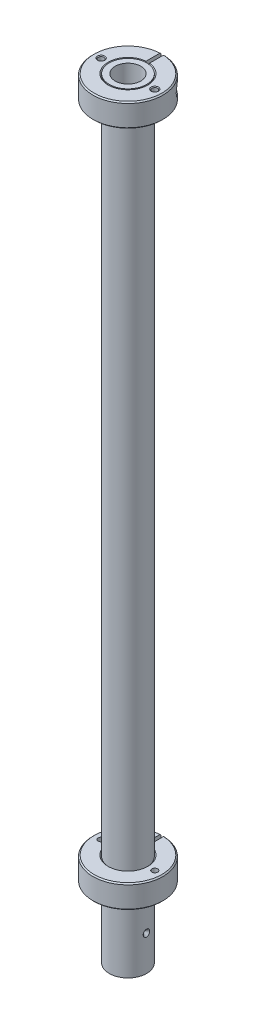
ISO-10303-21;
HEADER;
FILE_DESCRIPTION(('STEP AP214'),'2;1');
FILE_NAME('part.step','',(''),(''),'','','');
FILE_SCHEMA(('AUTOMOTIVE_DESIGN { 1 0 10303 214 1 1 1 1 }'));
ENDSEC;
DATA;
#1=APPLICATION_CONTEXT('core data for automotive mechanical design processes');
#2=APPLICATION_PROTOCOL_DEFINITION('international standard','automotive_design',2000,#1);
#3=PRODUCT_CONTEXT('',#1,'mechanical');
#4=PRODUCT('Part','Part','',(#3));
#5=PRODUCT_RELATED_PRODUCT_CATEGORY('part','',(#4));
#6=PRODUCT_DEFINITION_FORMATION('','',#4);
#7=PRODUCT_DEFINITION_CONTEXT('part definition',#1,'design');
#8=PRODUCT_DEFINITION('design','',#6,#7);
#9=PRODUCT_DEFINITION_SHAPE('','',#8);
#10=(LENGTH_UNIT() NAMED_UNIT(*) SI_UNIT(.MILLI.,.METRE.));
#11=(NAMED_UNIT(*) PLANE_ANGLE_UNIT() SI_UNIT($,.RADIAN.));
#12=(NAMED_UNIT(*) SI_UNIT($,.STERADIAN.) SOLID_ANGLE_UNIT());
#13=UNCERTAINTY_MEASURE_WITH_UNIT(LENGTH_MEASURE(1.E-05),#10,'distance_accuracy_value','');
#14=(GEOMETRIC_REPRESENTATION_CONTEXT(3) GLOBAL_UNCERTAINTY_ASSIGNED_CONTEXT((#13)) GLOBAL_UNIT_ASSIGNED_CONTEXT((#10,
#11,#12)) REPRESENTATION_CONTEXT('',''));
#15=CARTESIAN_POINT('',(0.,0.,0.));
#16=DIRECTION('',(0.,0.,1.));
#17=DIRECTION('',(1.,0.,0.));
#18=AXIS2_PLACEMENT_3D('',#15,#16,#17);
#19=CARTESIAN_POINT('',(-5.95,179.5,-411.));
#20=DIRECTION('',(-1.,0.,0.));
#21=DIRECTION('',(0.,0.,1.));
#22=AXIS2_PLACEMENT_3D('',#19,#20,#21);
#23=PLANE('',#22);
#24=DIRECTION('',(0.,-0.500000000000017,-0.866025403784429));
#25=VECTOR('',#24,1.);
#26=CARTESIAN_POINT('',(-5.95,178.056624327,-411.));
#27=LINE('',#26,#25);
#28=CARTESIAN_POINT('',(-5.95,178.056624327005,-410.999999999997));
#29=VERTEX_POINT('',#28);
#30=CARTESIAN_POINT('',(-5.95,178.778312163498,-409.749999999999));
#31=VERTEX_POINT('',#30);
#32=EDGE_CURVE('E264',#29,#31,#27,.F.);
#33=ORIENTED_EDGE('',*,*,#32,.T.);
#34=DIRECTION('',(0.,1.,0.));
#35=VECTOR('',#34,1.);
#36=CARTESIAN_POINT('',(-5.95,178.7783121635,-409.75));
#37=LINE('',#36,#35);
#38=CARTESIAN_POINT('',(-5.95,180.2216878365,-409.75));
#39=VERTEX_POINT('',#38);
#40=EDGE_CURVE('E261',#31,#39,#37,.T.);
#41=ORIENTED_EDGE('',*,*,#40,.T.);
#42=DIRECTION('',(0.,-0.500000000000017,0.866025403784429));
#43=VECTOR('',#42,1.);
#44=CARTESIAN_POINT('',(-5.95,180.2216878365,-409.75));
#45=LINE('',#44,#43);
#46=CARTESIAN_POINT('',(-5.95,180.943375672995,-411.000000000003));
#47=VERTEX_POINT('',#46);
#48=EDGE_CURVE('E258',#39,#47,#45,.F.);
#49=ORIENTED_EDGE('',*,*,#48,.T.);
#50=DIRECTION('',(0.,0.500000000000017,0.866025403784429));
#51=VECTOR('',#50,1.);
#52=CARTESIAN_POINT('',(-5.95,180.943375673,-411.));
#53=LINE('',#52,#51);
#54=CARTESIAN_POINT('',(-5.95,180.221687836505,-412.250000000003));
#55=VERTEX_POINT('',#54);
#56=EDGE_CURVE('E281',#47,#55,#53,.F.);
#57=ORIENTED_EDGE('',*,*,#56,.T.);
#58=DIRECTION('',(0.,1.,0.));
#59=VECTOR('',#58,1.);
#60=CARTESIAN_POINT('',(-5.95,180.2216878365,-412.25));
#61=LINE('',#60,#59);
#62=CARTESIAN_POINT('',(-5.95,178.7783121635,-412.25));
#63=VERTEX_POINT('',#62);
#64=EDGE_CURVE('E725',#55,#63,#61,.F.);
#65=ORIENTED_EDGE('',*,*,#64,.T.);
#66=DIRECTION('',(0.,0.500000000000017,-0.866025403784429));
#67=VECTOR('',#66,1.);
#68=CARTESIAN_POINT('',(-5.95,178.7783121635,-412.25));
#69=LINE('',#68,#67);
#70=EDGE_CURVE('E720',#63,#29,#69,.F.);
#71=ORIENTED_EDGE('',*,*,#70,.T.);
#72=EDGE_LOOP('',(#33,#41,#49,#57,#65,#71));
#73=FACE_BOUND('',#72,.T.);
#74=ADVANCED_FACE('F15',(#73),#23,.T.);
#75=CARTESIAN_POINT('',(5.95,469.5,-411.));
#76=DIRECTION('',(1.,0.,0.));
#77=DIRECTION('',(0.,0.,-1.));
#78=AXIS2_PLACEMENT_3D('',#75,#76,#77);
#79=PLANE('',#78);
#80=DIRECTION('',(0.,0.500000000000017,-0.866025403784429));
#81=VECTOR('',#80,1.);
#82=CARTESIAN_POINT('',(5.95,468.056624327,-411.));
#83=LINE('',#82,#81);
#84=CARTESIAN_POINT('',(5.95,468.056624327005,-411.000000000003));
#85=VERTEX_POINT('',#84);
#86=CARTESIAN_POINT('',(5.95,468.778312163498,-412.250000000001));
#87=VERTEX_POINT('',#86);
#88=EDGE_CURVE('E688',#85,#87,#83,.T.);
#89=ORIENTED_EDGE('',*,*,#88,.T.);
#90=DIRECTION('',(0.,1.,0.));
#91=VECTOR('',#90,1.);
#92=CARTESIAN_POINT('',(5.95,468.7783121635,-412.25));
#93=LINE('',#92,#91);
#94=CARTESIAN_POINT('',(5.95,470.2216878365,-412.25));
#95=VERTEX_POINT('',#94);
#96=EDGE_CURVE('E712',#87,#95,#93,.T.);
#97=ORIENTED_EDGE('',*,*,#96,.T.);
#98=DIRECTION('',(0.,0.500000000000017,0.866025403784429));
#99=VECTOR('',#98,1.);
#100=CARTESIAN_POINT('',(5.95,470.2216878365,-412.25));
#101=LINE('',#100,#99);
#102=CARTESIAN_POINT('',(5.95,470.943375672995,-410.999999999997));
#103=VERTEX_POINT('',#102);
#104=EDGE_CURVE('E707',#95,#103,#101,.T.);
#105=ORIENTED_EDGE('',*,*,#104,.T.);
#106=DIRECTION('',(0.,-0.500000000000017,0.866025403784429));
#107=VECTOR('',#106,1.);
#108=CARTESIAN_POINT('',(5.95,470.943375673,-411.));
#109=LINE('',#108,#107);
#110=CARTESIAN_POINT('',(5.95,470.221687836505,-409.749999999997));
#111=VERTEX_POINT('',#110);
#112=EDGE_CURVE('E702',#103,#111,#109,.T.);
#113=ORIENTED_EDGE('',*,*,#112,.T.);
#114=DIRECTION('',(0.,1.,0.));
#115=VECTOR('',#114,1.);
#116=CARTESIAN_POINT('',(5.95,470.2216878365,-409.75));
#117=LINE('',#116,#115);
#118=CARTESIAN_POINT('',(5.95,468.7783121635,-409.75));
#119=VERTEX_POINT('',#118);
#120=EDGE_CURVE('E697',#111,#119,#117,.F.);
#121=ORIENTED_EDGE('',*,*,#120,.T.);
#122=DIRECTION('',(0.,-0.500000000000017,-0.866025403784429));
#123=VECTOR('',#122,1.);
#124=CARTESIAN_POINT('',(5.95,468.7783121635,-409.75));
#125=LINE('',#124,#123);
#126=EDGE_CURVE('E692',#119,#85,#125,.T.);
#127=ORIENTED_EDGE('',*,*,#126,.T.);
#128=EDGE_LOOP('',(#89,#97,#105,#113,#121,#127));
#129=FACE_BOUND('',#128,.T.);
#130=ADVANCED_FACE('F521',(#129),#79,.T.);
#131=CARTESIAN_POINT('',(-7.25,178.7783121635,-409.75));
#132=DIRECTION('',(0.,0.,1.));
#133=DIRECTION('',(1.,0.,0.));
#134=AXIS2_PLACEMENT_3D('',#131,#132,#133);
#135=PLANE('',#134);
#136=ORIENTED_EDGE('',*,*,#40,.F.);
#137=DIRECTION('',(1.,0.,0.));
#138=VECTOR('',#137,1.);
#139=CARTESIAN_POINT('',(-7.25,178.77831216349,-409.749999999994));
#140=LINE('',#139,#138);
#141=CARTESIAN_POINT('',(-7.25,178.778312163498,-409.749999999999));
#142=VERTEX_POINT('',#141);
#143=EDGE_CURVE('E714',#31,#142,#140,.F.);
#144=ORIENTED_EDGE('',*,*,#143,.T.);
#145=DIRECTION('',(0.,1.,0.));
#146=VECTOR('',#145,1.);
#147=CARTESIAN_POINT('',(-7.25,179.5,-409.75));
#148=LINE('',#147,#146);
#149=CARTESIAN_POINT('',(-7.25,180.2216878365,-409.75));
#150=VERTEX_POINT('',#149);
#151=EDGE_CURVE('E272',#142,#150,#148,.T.);
#152=ORIENTED_EDGE('',*,*,#151,.T.);
#153=DIRECTION('',(1.,0.,0.));
#154=VECTOR('',#153,1.);
#155=CARTESIAN_POINT('',(-7.25,180.2216878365,-409.75));
#156=LINE('',#155,#154);
#157=EDGE_CURVE('E267',#150,#39,#156,.T.);
#158=ORIENTED_EDGE('',*,*,#157,.T.);
#159=EDGE_LOOP('',(#136,#144,#152,#158));
#160=FACE_BOUND('',#159,.T.);
#161=ADVANCED_FACE('F270',(#160),#135,.F.);
#162=CARTESIAN_POINT('',(-7.25,180.2216878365,-409.75));
#163=DIRECTION('',(0.,0.866025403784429,0.500000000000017));
#164=DIRECTION('',(0.,-0.500000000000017,0.866025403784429));
#165=AXIS2_PLACEMENT_3D('',#162,#163,#164);
#166=PLANE('',#165);
#167=ORIENTED_EDGE('',*,*,#48,.F.);
#168=ORIENTED_EDGE('',*,*,#157,.F.);
#169=DIRECTION('',(0.,0.500000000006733,-0.866025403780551));
#170=VECTOR('',#169,1.);
#171=CARTESIAN_POINT('',(-7.25,180.2216878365,-409.75));
#172=LINE('',#171,#170);
#173=CARTESIAN_POINT('',(-7.25,180.943375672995,-411.000000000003));
#174=VERTEX_POINT('',#173);
#175=EDGE_CURVE('E683',#150,#174,#172,.T.);
#176=ORIENTED_EDGE('',*,*,#175,.T.);
#177=DIRECTION('',(1.,0.,0.));
#178=VECTOR('',#177,1.);
#179=CARTESIAN_POINT('',(-7.25,180.943375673,-411.));
#180=LINE('',#179,#178);
#181=EDGE_CURVE('E278',#174,#47,#180,.T.);
#182=ORIENTED_EDGE('',*,*,#181,.T.);
#183=EDGE_LOOP('',(#167,#168,#176,#182));
#184=FACE_BOUND('',#183,.T.);
#185=ADVANCED_FACE('F276',(#184),#166,.F.);
#186=CARTESIAN_POINT('',(-7.25,180.943375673,-411.));
#187=DIRECTION('',(0.,0.866025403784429,-0.500000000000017));
#188=DIRECTION('',(0.,0.500000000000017,0.866025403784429));
#189=AXIS2_PLACEMENT_3D('',#186,#187,#188);
#190=PLANE('',#189);
#191=ORIENTED_EDGE('',*,*,#56,.F.);
#192=ORIENTED_EDGE('',*,*,#181,.F.);
#193=DIRECTION('',(0.,-0.50000000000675,-0.866025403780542));
#194=VECTOR('',#193,1.);
#195=CARTESIAN_POINT('',(-7.25,180.943375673,-411.));
#196=LINE('',#195,#194);
#197=CARTESIAN_POINT('',(-7.25,180.221687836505,-412.250000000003));
#198=VERTEX_POINT('',#197);
#199=EDGE_CURVE('E681',#174,#198,#196,.T.);
#200=ORIENTED_EDGE('',*,*,#199,.T.);
#201=DIRECTION('',(-1.,0.,0.));
#202=VECTOR('',#201,1.);
#203=CARTESIAN_POINT('',(-7.25,180.2216878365,-412.25));
#204=LINE('',#203,#202);
#205=EDGE_CURVE('E727',#198,#55,#204,.F.);
#206=ORIENTED_EDGE('',*,*,#205,.T.);
#207=EDGE_LOOP('',(#191,#192,#200,#206));
#208=FACE_BOUND('',#207,.T.);
#209=ADVANCED_FACE('F513',(#208),#190,.F.);
#210=CARTESIAN_POINT('',(-7.25,180.2216878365,-412.25));
#211=DIRECTION('',(0.,0.,-1.));
#212=DIRECTION('',(-1.,0.,0.));
#213=AXIS2_PLACEMENT_3D('',#210,#211,#212);
#214=PLANE('',#213);
#215=ORIENTED_EDGE('',*,*,#64,.F.);
#216=ORIENTED_EDGE('',*,*,#205,.F.);
#217=DIRECTION('',(0.,1.,0.));
#218=VECTOR('',#217,1.);
#219=CARTESIAN_POINT('',(-7.25,179.5,-412.25));
#220=LINE('',#219,#218);
#221=CARTESIAN_POINT('',(-7.25,178.7783121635,-412.25));
#222=VERTEX_POINT('',#221);
#223=EDGE_CURVE('E679',#198,#222,#220,.F.);
#224=ORIENTED_EDGE('',*,*,#223,.T.);
#225=DIRECTION('',(1.,0.,0.));
#226=VECTOR('',#225,1.);
#227=CARTESIAN_POINT('',(-7.25,178.7783121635,-412.25));
#228=LINE('',#227,#226);
#229=EDGE_CURVE('E722',#222,#63,#228,.T.);
#230=ORIENTED_EDGE('',*,*,#229,.T.);
#231=EDGE_LOOP('',(#215,#216,#224,#230));
#232=FACE_BOUND('',#231,.T.);
#233=ADVANCED_FACE('F509',(#232),#214,.F.);
#234=CARTESIAN_POINT('',(-7.25,178.7783121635,-412.25));
#235=DIRECTION('',(0.,-0.866025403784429,-0.500000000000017));
#236=DIRECTION('',(0.,0.500000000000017,-0.866025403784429));
#237=AXIS2_PLACEMENT_3D('',#234,#235,#236);
#238=PLANE('',#237);
#239=ORIENTED_EDGE('',*,*,#70,.F.);
#240=ORIENTED_EDGE('',*,*,#229,.F.);
#241=DIRECTION('',(0.,-0.50000000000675,0.866025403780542));
#242=VECTOR('',#241,1.);
#243=CARTESIAN_POINT('',(-7.25,178.7783121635,-412.25));
#244=LINE('',#243,#242);
#245=CARTESIAN_POINT('',(-7.25,178.056624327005,-410.999999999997));
#246=VERTEX_POINT('',#245);
#247=EDGE_CURVE('E677',#222,#246,#244,.T.);
#248=ORIENTED_EDGE('',*,*,#247,.T.);
#249=DIRECTION('',(1.,0.,0.));
#250=VECTOR('',#249,1.);
#251=CARTESIAN_POINT('',(-7.25,178.056624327,-411.));
#252=LINE('',#251,#250);
#253=EDGE_CURVE('E717',#246,#29,#252,.T.);
#254=ORIENTED_EDGE('',*,*,#253,.T.);
#255=EDGE_LOOP('',(#239,#240,#248,#254));
#256=FACE_BOUND('',#255,.T.);
#257=ADVANCED_FACE('F505',(#256),#238,.F.);
#258=CARTESIAN_POINT('',(-7.25,178.056624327,-411.));
#259=DIRECTION('',(0.,-0.866025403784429,0.500000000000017));
#260=DIRECTION('',(0.,-0.500000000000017,-0.866025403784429));
#261=AXIS2_PLACEMENT_3D('',#258,#259,#260);
#262=PLANE('',#261);
#263=ORIENTED_EDGE('',*,*,#32,.F.);
#264=ORIENTED_EDGE('',*,*,#253,.F.);
#265=DIRECTION('',(0.,0.500000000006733,0.866025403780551));
#266=VECTOR('',#265,1.);
#267=CARTESIAN_POINT('',(-7.25,178.056624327,-411.));
#268=LINE('',#267,#266);
#269=EDGE_CURVE('E674',#246,#142,#268,.T.);
#270=ORIENTED_EDGE('',*,*,#269,.T.);
#271=ORIENTED_EDGE('',*,*,#143,.F.);
#272=EDGE_LOOP('',(#263,#264,#270,#271));
#273=FACE_BOUND('',#272,.T.);
#274=ADVANCED_FACE('F501',(#273),#262,.F.);
#275=CARTESIAN_POINT('',(7.25,468.7783121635,-412.25));
#276=DIRECTION('',(0.,0.,-1.));
#277=DIRECTION('',(-1.,0.,0.));
#278=AXIS2_PLACEMENT_3D('',#275,#276,#277);
#279=PLANE('',#278);
#280=ORIENTED_EDGE('',*,*,#96,.F.);
#281=DIRECTION('',(1.,0.,0.));
#282=VECTOR('',#281,1.);
#283=CARTESIAN_POINT('',(7.25,468.77831216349,-412.250000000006));
#284=LINE('',#283,#282);
#285=CARTESIAN_POINT('',(7.25,468.778312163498,-412.250000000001));
#286=VERTEX_POINT('',#285);
#287=EDGE_CURVE('E686',#87,#286,#284,.T.);
#288=ORIENTED_EDGE('',*,*,#287,.T.);
#289=DIRECTION('',(0.,1.,0.));
#290=VECTOR('',#289,1.);
#291=CARTESIAN_POINT('',(7.25,469.5,-412.25));
#292=LINE('',#291,#290);
#293=CARTESIAN_POINT('',(7.25,470.2216878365,-412.25));
#294=VERTEX_POINT('',#293);
#295=EDGE_CURVE('E672',#286,#294,#292,.T.);
#296=ORIENTED_EDGE('',*,*,#295,.T.);
#297=DIRECTION('',(1.,0.,0.));
#298=VECTOR('',#297,1.);
#299=CARTESIAN_POINT('',(7.25,470.2216878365,-412.25));
#300=LINE('',#299,#298);
#301=EDGE_CURVE('E709',#294,#95,#300,.F.);
#302=ORIENTED_EDGE('',*,*,#301,.T.);
#303=EDGE_LOOP('',(#280,#288,#296,#302));
#304=FACE_BOUND('',#303,.T.);
#305=ADVANCED_FACE('F497',(#304),#279,.F.);
#306=CARTESIAN_POINT('',(7.25,470.2216878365,-412.25));
#307=DIRECTION('',(0.,0.866025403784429,-0.500000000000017));
#308=DIRECTION('',(0.,0.500000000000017,0.866025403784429));
#309=AXIS2_PLACEMENT_3D('',#306,#307,#308);
#310=PLANE('',#309);
#311=ORIENTED_EDGE('',*,*,#104,.F.);
#312=ORIENTED_EDGE('',*,*,#301,.F.);
#313=DIRECTION('',(0.,0.50000000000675,0.866025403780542));
#314=VECTOR('',#313,1.);
#315=CARTESIAN_POINT('',(7.25,470.2216878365,-412.25));
#316=LINE('',#315,#314);
#317=CARTESIAN_POINT('',(7.25,470.943375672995,-410.999999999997));
#318=VERTEX_POINT('',#317);
#319=EDGE_CURVE('E670',#294,#318,#316,.T.);
#320=ORIENTED_EDGE('',*,*,#319,.T.);
#321=DIRECTION('',(1.,0.,0.));
#322=VECTOR('',#321,1.);
#323=CARTESIAN_POINT('',(7.25,470.943375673,-411.));
#324=LINE('',#323,#322);
#325=EDGE_CURVE('E704',#318,#103,#324,.F.);
#326=ORIENTED_EDGE('',*,*,#325,.T.);
#327=EDGE_LOOP('',(#311,#312,#320,#326));
#328=FACE_BOUND('',#327,.T.);
#329=ADVANCED_FACE('F493',(#328),#310,.F.);
#330=CARTESIAN_POINT('',(7.25,470.943375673,-411.));
#331=DIRECTION('',(0.,0.866025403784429,0.500000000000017));
#332=DIRECTION('',(0.,-0.500000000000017,0.866025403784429));
#333=AXIS2_PLACEMENT_3D('',#330,#331,#332);
#334=PLANE('',#333);
#335=ORIENTED_EDGE('',*,*,#112,.F.);
#336=ORIENTED_EDGE('',*,*,#325,.F.);
#337=DIRECTION('',(0.,-0.500000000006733,0.866025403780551));
#338=VECTOR('',#337,1.);
#339=CARTESIAN_POINT('',(7.25,470.943375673,-411.));
#340=LINE('',#339,#338);
#341=CARTESIAN_POINT('',(7.25,470.221687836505,-409.749999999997));
#342=VERTEX_POINT('',#341);
#343=EDGE_CURVE('E668',#318,#342,#340,.T.);
#344=ORIENTED_EDGE('',*,*,#343,.T.);
#345=DIRECTION('',(1.,0.,0.));
#346=VECTOR('',#345,1.);
#347=CARTESIAN_POINT('',(7.25,470.2216878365,-409.75));
#348=LINE('',#347,#346);
#349=EDGE_CURVE('E699',#342,#111,#348,.F.);
#350=ORIENTED_EDGE('',*,*,#349,.T.);
#351=EDGE_LOOP('',(#335,#336,#344,#350));
#352=FACE_BOUND('',#351,.T.);
#353=ADVANCED_FACE('F489',(#352),#334,.F.);
#354=CARTESIAN_POINT('',(7.25,470.2216878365,-409.75));
#355=DIRECTION('',(0.,0.,1.));
#356=DIRECTION('',(1.,0.,0.));
#357=AXIS2_PLACEMENT_3D('',#354,#355,#356);
#358=PLANE('',#357);
#359=ORIENTED_EDGE('',*,*,#120,.F.);
#360=ORIENTED_EDGE('',*,*,#349,.F.);
#361=DIRECTION('',(0.,1.,0.));
#362=VECTOR('',#361,1.);
#363=CARTESIAN_POINT('',(7.25,469.5,-409.75));
#364=LINE('',#363,#362);
#365=CARTESIAN_POINT('',(7.25,468.7783121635,-409.75));
#366=VERTEX_POINT('',#365);
#367=EDGE_CURVE('E666',#342,#366,#364,.F.);
#368=ORIENTED_EDGE('',*,*,#367,.T.);
#369=DIRECTION('',(1.,0.,0.));
#370=VECTOR('',#369,1.);
#371=CARTESIAN_POINT('',(7.25,468.7783121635,-409.75));
#372=LINE('',#371,#370);
#373=EDGE_CURVE('E694',#366,#119,#372,.F.);
#374=ORIENTED_EDGE('',*,*,#373,.T.);
#375=EDGE_LOOP('',(#359,#360,#368,#374));
#376=FACE_BOUND('',#375,.T.);
#377=ADVANCED_FACE('F486',(#376),#358,.F.);
#378=CARTESIAN_POINT('',(7.25,468.7783121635,-409.75));
#379=DIRECTION('',(0.,-0.866025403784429,0.500000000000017));
#380=DIRECTION('',(0.,-0.500000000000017,-0.866025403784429));
#381=AXIS2_PLACEMENT_3D('',#378,#379,#380);
#382=PLANE('',#381);
#383=ORIENTED_EDGE('',*,*,#126,.F.);
#384=ORIENTED_EDGE('',*,*,#373,.F.);
#385=DIRECTION('',(0.,-0.500000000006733,-0.866025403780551));
#386=VECTOR('',#385,1.);
#387=CARTESIAN_POINT('',(7.25,468.7783121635,-409.75));
#388=LINE('',#387,#386);
#389=CARTESIAN_POINT('',(7.25,468.056624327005,-411.000000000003));
#390=VERTEX_POINT('',#389);
#391=EDGE_CURVE('E188',#366,#390,#388,.T.);
#392=ORIENTED_EDGE('',*,*,#391,.T.);
#393=DIRECTION('',(1.,0.,0.));
#394=VECTOR('',#393,1.);
#395=CARTESIAN_POINT('',(7.25,468.056624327,-411.));
#396=LINE('',#395,#394);
#397=EDGE_CURVE('E690',#390,#85,#396,.F.);
#398=ORIENTED_EDGE('',*,*,#397,.T.);
#399=EDGE_LOOP('',(#383,#384,#392,#398));
#400=FACE_BOUND('',#399,.T.);
#401=ADVANCED_FACE('F482',(#400),#382,.F.);
#402=CARTESIAN_POINT('',(7.25,468.056624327,-411.));
#403=DIRECTION('',(0.,-0.866025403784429,-0.500000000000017));
#404=DIRECTION('',(0.,0.500000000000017,-0.866025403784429));
#405=AXIS2_PLACEMENT_3D('',#402,#403,#404);
#406=PLANE('',#405);
#407=ORIENTED_EDGE('',*,*,#88,.F.);
#408=ORIENTED_EDGE('',*,*,#397,.F.);
#409=DIRECTION('',(0.,0.50000000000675,-0.866025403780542));
#410=VECTOR('',#409,1.);
#411=CARTESIAN_POINT('',(7.25,468.056624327,-411.));
#412=LINE('',#411,#410);
#413=EDGE_CURVE('E662',#390,#286,#412,.T.);
#414=ORIENTED_EDGE('',*,*,#413,.T.);
#415=ORIENTED_EDGE('',*,*,#287,.F.);
#416=EDGE_LOOP('',(#407,#408,#414,#415));
#417=FACE_BOUND('',#416,.T.);
#418=ADVANCED_FACE('F478',(#417),#406,.F.);
#419=CARTESIAN_POINT('',(-7.25,179.5,-411.));
#420=DIRECTION('',(1.,0.,0.));
#421=DIRECTION('',(0.,0.,-1.));
#422=AXIS2_PLACEMENT_3D('',#419,#420,#421);
#423=PLANE('',#422);
#424=ORIENTED_EDGE('',*,*,#247,.F.);
#425=ORIENTED_EDGE('',*,*,#223,.F.);
#426=ORIENTED_EDGE('',*,*,#199,.F.);
#427=ORIENTED_EDGE('',*,*,#175,.F.);
#428=ORIENTED_EDGE('',*,*,#151,.F.);
#429=ORIENTED_EDGE('',*,*,#269,.F.);
#430=EDGE_LOOP('',(#424,#425,#426,#427,#428,#429));
#431=FACE_BOUND('',#430,.T.);
#432=CARTESIAN_POINT('',(-7.24999999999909,179.5,-411.));
#433=DIRECTION('',(1.,0.,0.));
#434=DIRECTION('',(0.,0.,-1.));
#435=AXIS2_PLACEMENT_3D('',#432,#433,#434);
#436=CIRCLE('',#435,2.3499999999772);
#437=CARTESIAN_POINT('',(-7.24999999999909,179.5,-413.349999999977));
#438=VERTEX_POINT('',#437);
#439=EDGE_CURVE('E18',#438,#438,#436,.T.);
#440=ORIENTED_EDGE('',*,*,#439,.F.);
#441=EDGE_LOOP('',(#440));
#442=FACE_BOUND('',#441,.T.);
#443=ADVANCED_FACE('F474',(#431,#442),#423,.F.);
#444=CARTESIAN_POINT('',(7.25,469.5,-411.));
#445=DIRECTION('',(-1.,0.,0.));
#446=DIRECTION('',(0.,0.,1.));
#447=AXIS2_PLACEMENT_3D('',#444,#445,#446);
#448=PLANE('',#447);
#449=ORIENTED_EDGE('',*,*,#391,.F.);
#450=ORIENTED_EDGE('',*,*,#367,.F.);
#451=ORIENTED_EDGE('',*,*,#343,.F.);
#452=ORIENTED_EDGE('',*,*,#319,.F.);
#453=ORIENTED_EDGE('',*,*,#295,.F.);
#454=ORIENTED_EDGE('',*,*,#413,.F.);
#455=EDGE_LOOP('',(#449,#450,#451,#452,#453,#454));
#456=FACE_BOUND('',#455,.T.);
#457=CARTESIAN_POINT('',(7.24999999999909,469.5,-411.));
#458=DIRECTION('',(-1.,0.,0.));
#459=DIRECTION('',(0.,0.,1.));
#460=AXIS2_PLACEMENT_3D('',#457,#458,#459);
#461=CIRCLE('',#460,2.34999999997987);
#462=CARTESIAN_POINT('',(7.24999999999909,469.5,-408.65000000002));
#463=VERTEX_POINT('',#462);
#464=EDGE_CURVE('E661',#463,#463,#461,.T.);
#465=ORIENTED_EDGE('',*,*,#464,.F.);
#466=EDGE_LOOP('',(#465));
#467=FACE_BOUND('',#466,.T.);
#468=ADVANCED_FACE('F470',(#456,#467),#448,.F.);
#469=CARTESIAN_POINT('',(-6.8500000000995,179.5,-411.));
#470=DIRECTION('',(1.,0.,0.));
#471=DIRECTION('',(0.,0.,-1.));
#472=AXIS2_PLACEMENT_3D('',#469,#470,#471);
#473=CONICAL_SURFACE('',#472,2.7499999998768,0.785398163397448);
#474=CARTESIAN_POINT('',(-6.85,179.5,-411.));
#475=DIRECTION('',(1.,0.,0.));
#476=DIRECTION('',(0.,0.,-1.));
#477=AXIS2_PLACEMENT_3D('',#474,#475,#476);
#478=CIRCLE('',#477,2.75);
#479=CARTESIAN_POINT('',(-6.85,179.5,-413.75));
#480=VERTEX_POINT('',#479);
#481=EDGE_CURVE('E658',#480,#480,#478,.T.);
#482=ORIENTED_EDGE('',*,*,#481,.F.);
#483=EDGE_LOOP('',(#482));
#484=FACE_BOUND('',#483,.T.);
#485=ORIENTED_EDGE('',*,*,#439,.T.);
#486=EDGE_LOOP('',(#485));
#487=FACE_BOUND('',#486,.T.);
#488=ADVANCED_FACE('F466',(#484,#487),#473,.T.);
#489=CARTESIAN_POINT('',(6.85000000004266,469.5,-411.));
#490=DIRECTION('',(-1.,0.,0.));
#491=DIRECTION('',(0.,0.,1.));
#492=AXIS2_PLACEMENT_3D('',#489,#490,#491);
#493=CONICAL_SURFACE('',#492,2.7499999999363,0.785398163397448);
#494=CARTESIAN_POINT('',(6.85,469.5,-411.));
#495=DIRECTION('',(-1.,0.,0.));
#496=DIRECTION('',(0.,0.,1.));
#497=AXIS2_PLACEMENT_3D('',#494,#495,#496);
#498=CIRCLE('',#497,2.75);
#499=CARTESIAN_POINT('',(6.85,469.5,-408.25));
#500=VERTEX_POINT('',#499);
#501=EDGE_CURVE('E655',#500,#500,#498,.T.);
#502=ORIENTED_EDGE('',*,*,#501,.F.);
#503=EDGE_LOOP('',(#502));
#504=FACE_BOUND('',#503,.T.);
#505=ORIENTED_EDGE('',*,*,#464,.T.);
#506=EDGE_LOOP('',(#505));
#507=FACE_BOUND('',#506,.T.);
#508=ADVANCED_FACE('F462',(#504,#507),#493,.T.);
#509=CARTESIAN_POINT('',(5.75,179.5,-411.));
#510=DIRECTION('',(1.,0.,0.));
#511=DIRECTION('',(0.,0.,-1.));
#512=AXIS2_PLACEMENT_3D('',#509,#510,#511);
#513=PLANE('',#512);
#514=CARTESIAN_POINT('',(5.75,179.5,-411.));
#515=DIRECTION('',(-1.,0.,0.));
#516=DIRECTION('',(0.,0.,1.));
#517=AXIS2_PLACEMENT_3D('',#514,#515,#516);
#518=CIRCLE('',#517,1.25);
#519=CARTESIAN_POINT('',(5.75,179.5,-409.75));
#520=VERTEX_POINT('',#519);
#521=EDGE_CURVE('E625',#520,#520,#518,.F.);
#522=ORIENTED_EDGE('',*,*,#521,.T.);
#523=EDGE_LOOP('',(#522));
#524=FACE_BOUND('',#523,.T.);
#525=ADVANCED_FACE('F458',(#524),#513,.T.);
#526=CARTESIAN_POINT('',(-7.9,179.5,-411.));
#527=DIRECTION('',(1.,0.,0.));
#528=DIRECTION('',(0.,0.,-1.));
#529=AXIS2_PLACEMENT_3D('',#526,#527,#528);
#530=CYLINDRICAL_SURFACE('',#529,2.75);
#531=ORIENTED_EDGE('',*,*,#481,.T.);
#532=EDGE_LOOP('',(#531));
#533=FACE_BOUND('',#532,.T.);
#534=CARTESIAN_POINT('',(-4.25,179.5,-411.));
#535=DIRECTION('',(1.,0.,0.));
#536=DIRECTION('',(0.,0.,-1.));
#537=AXIS2_PLACEMENT_3D('',#534,#535,#536);
#538=CIRCLE('',#537,2.75);
#539=CARTESIAN_POINT('',(-4.25,179.5,-413.75));
#540=VERTEX_POINT('',#539);
#541=EDGE_CURVE('E613',#540,#540,#538,.T.);
#542=ORIENTED_EDGE('',*,*,#541,.F.);
#543=EDGE_LOOP('',(#542));
#544=FACE_BOUND('',#543,.T.);
#545=ADVANCED_FACE('F454',(#533,#544),#530,.T.);
#546=CARTESIAN_POINT('',(-5.75,469.5,-411.));
#547=DIRECTION('',(-1.,0.,0.));
#548=DIRECTION('',(0.,0.,1.));
#549=AXIS2_PLACEMENT_3D('',#546,#547,#548);
#550=PLANE('',#549);
#551=CARTESIAN_POINT('',(-5.75,469.5,-411.));
#552=DIRECTION('',(1.,0.,0.));
#553=DIRECTION('',(0.,0.,-1.));
#554=AXIS2_PLACEMENT_3D('',#551,#552,#553);
#555=CIRCLE('',#554,1.25);
#556=CARTESIAN_POINT('',(-5.75,469.5,-412.25));
#557=VERTEX_POINT('',#556);
#558=EDGE_CURVE('E373',#557,#557,#555,.F.);
#559=ORIENTED_EDGE('',*,*,#558,.T.);
#560=EDGE_LOOP('',(#559));
#561=FACE_BOUND('',#560,.T.);
#562=ADVANCED_FACE('F450',(#561),#550,.T.);
#563=CARTESIAN_POINT('',(7.9,469.5,-411.));
#564=DIRECTION('',(-1.,0.,0.));
#565=DIRECTION('',(0.,0.,1.));
#566=AXIS2_PLACEMENT_3D('',#563,#564,#565);
#567=CYLINDRICAL_SURFACE('',#566,2.75);
#568=ORIENTED_EDGE('',*,*,#501,.T.);
#569=EDGE_LOOP('',(#568));
#570=FACE_BOUND('',#569,.T.);
#571=CARTESIAN_POINT('',(4.25,469.5,-411.));
#572=DIRECTION('',(-1.,0.,0.));
#573=DIRECTION('',(0.,0.,1.));
#574=AXIS2_PLACEMENT_3D('',#571,#572,#573);
#575=CIRCLE('',#574,2.75);
#576=CARTESIAN_POINT('',(4.25,469.5,-408.25));
#577=VERTEX_POINT('',#576);
#578=EDGE_CURVE('E596',#577,#577,#575,.T.);
#579=ORIENTED_EDGE('',*,*,#578,.F.);
#580=EDGE_LOOP('',(#579));
#581=FACE_BOUND('',#580,.T.);
#582=ADVANCED_FACE('F446',(#570,#581),#567,.T.);
#583=CARTESIAN_POINT('',(20.4375,179.5,-411.));
#584=DIRECTION('',(-1.,0.,0.));
#585=DIRECTION('',(0.,0.,1.));
#586=AXIS2_PLACEMENT_3D('',#583,#584,#585);
#587=CYLINDRICAL_SURFACE('',#586,1.25);
#588=CARTESIAN_POINT('',(10.1980390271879,180.75,-410.999999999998));
#589=CARTESIAN_POINT('',(10.0843886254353,180.750006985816,-411.105358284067));
#590=CARTESIAN_POINT('',(9.9689637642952,180.736747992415,-411.209057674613));
#591=CARTESIAN_POINT('',(9.79595080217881,180.698220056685,-411.359810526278));
#592=CARTESIAN_POINT('',(9.73821452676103,180.682233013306,-411.409332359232));
#593=CARTESIAN_POINT('',(9.62323343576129,180.643985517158,-411.506477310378));
#594=CARTESIAN_POINT('',(9.56598841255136,180.62172786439,-411.554101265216));
#595=CARTESIAN_POINT('',(9.42817765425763,180.55984846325,-411.667066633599));
#596=CARTESIAN_POINT('',(9.34813786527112,180.516873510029,-411.731248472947));
#597=CARTESIAN_POINT('',(9.19259018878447,180.416647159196,-411.853522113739));
#598=CARTESIAN_POINT('',(9.11707033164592,180.359435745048,-411.911630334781));
#599=CARTESIAN_POINT('',(9.00232759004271,180.253932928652,-411.998379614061));
#600=CARTESIAN_POINT('',(8.96039644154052,180.210802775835,-412.029701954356));
#601=CARTESIAN_POINT('',(8.88142360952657,180.117662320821,-412.088122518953));
#602=CARTESIAN_POINT('',(8.844376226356,180.067660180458,-412.115225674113));
#603=CARTESIAN_POINT('',(8.78596789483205,179.973677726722,-412.157620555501));
#604=CARTESIAN_POINT('',(8.76299558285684,179.931281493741,-412.174174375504));
#605=CARTESIAN_POINT('',(8.72272929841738,179.842520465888,-412.203057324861));
#606=CARTESIAN_POINT('',(8.70542619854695,179.796162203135,-412.215393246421));
#607=CARTESIAN_POINT('',(8.6804623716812,179.708561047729,-412.233142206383));
#608=CARTESIAN_POINT('',(8.67165229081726,179.667817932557,-412.239383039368));
#609=CARTESIAN_POINT('',(8.6597726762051,179.585092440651,-412.247791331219));
#610=CARTESIAN_POINT('',(8.65669888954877,179.543111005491,-412.249961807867));
#611=CARTESIAN_POINT('',(8.65659216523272,179.459082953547,-412.250037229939));
#612=CARTESIAN_POINT('',(8.65956686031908,179.417036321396,-412.24793678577));
#613=CARTESIAN_POINT('',(8.67127209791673,179.334165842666,-412.239652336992));
#614=CARTESIAN_POINT('',(8.68000690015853,179.293342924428,-412.233465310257));
#615=CARTESIAN_POINT('',(8.70516991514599,179.204373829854,-412.215576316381));
#616=CARTESIAN_POINT('',(8.72293650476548,179.156804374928,-412.202910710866));
#617=CARTESIAN_POINT('',(8.76440773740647,179.065833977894,-412.173159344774));
#618=CARTESIAN_POINT('',(8.78812330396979,179.022440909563,-412.15606545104));
#619=CARTESIAN_POINT('',(8.85248147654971,178.919975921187,-412.109327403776));
#620=CARTESIAN_POINT('',(8.89575291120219,178.863516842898,-412.077618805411));
#621=CARTESIAN_POINT('',(8.98827159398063,178.759410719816,-412.008926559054));
#622=CARTESIAN_POINT('',(9.03753323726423,178.711785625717,-411.971930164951));
#623=CARTESIAN_POINT('',(9.12947156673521,178.633259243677,-411.901906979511));
#624=CARTESIAN_POINT('',(9.17147675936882,178.600921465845,-411.869580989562));
#625=CARTESIAN_POINT('',(9.25716118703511,178.540885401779,-411.802877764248));
#626=CARTESIAN_POINT('',(9.30084138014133,178.513189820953,-411.768499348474));
#627=CARTESIAN_POINT('',(9.43360446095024,178.43658511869,-411.662755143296));
#628=CARTESIAN_POINT('',(9.52440500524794,178.394161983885,-411.588784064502));
#629=CARTESIAN_POINT('',(9.71260823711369,178.323543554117,-411.431584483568));
#630=CARTESIAN_POINT('',(9.81010173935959,178.296245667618,-411.348071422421));
#631=CARTESIAN_POINT('',(10.0047927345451,178.259473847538,-411.176802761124));
#632=CARTESIAN_POINT('',(10.1019901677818,178.250003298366,-411.089046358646));
#633=CARTESIAN_POINT('',(10.2981212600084,178.249996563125,-410.907214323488));
#634=CARTESIAN_POINT('',(10.3969564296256,178.260272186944,-410.813028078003));
#635=CARTESIAN_POINT('',(10.5894363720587,178.30380443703,-410.624586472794));
#636=CARTESIAN_POINT('',(10.6830904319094,178.337018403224,-410.530331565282));
#637=CARTESIAN_POINT('',(10.8301491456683,178.413352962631,-410.378577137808));
#638=CARTESIAN_POINT('',(10.886151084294,178.448914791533,-410.319779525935));
#639=CARTESIAN_POINT('',(10.9929140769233,178.532027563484,-410.205972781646));
#640=CARTESIAN_POINT('',(11.0436823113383,178.579561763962,-410.15095849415));
#641=CARTESIAN_POINT('',(11.1283772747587,178.676241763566,-410.057949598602));
#642=CARTESIAN_POINT('',(11.1636271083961,178.723081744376,-410.018772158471));
#643=CARTESIAN_POINT('',(11.2282726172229,178.824699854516,-409.946267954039));
#644=CARTESIAN_POINT('',(11.2576748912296,178.879468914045,-409.912934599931));
#645=CARTESIAN_POINT('',(11.3048429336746,178.986409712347,-409.859086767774));
#646=CARTESIAN_POINT('',(11.3237339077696,179.037470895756,-409.837359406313));
#647=CARTESIAN_POINT('',(11.355612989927,179.143690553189,-409.800543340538));
#648=CARTESIAN_POINT('',(11.3686039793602,179.19884701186,-409.785451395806));
#649=CARTESIAN_POINT('',(11.3880226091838,179.312116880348,-409.762846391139));
#650=CARTESIAN_POINT('',(11.3944186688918,179.370243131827,-409.755369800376));
#651=CARTESIAN_POINT('',(11.4001331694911,179.487314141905,-409.748691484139));
#652=CARTESIAN_POINT('',(11.3994534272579,179.546258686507,-409.749487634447));
#653=CARTESIAN_POINT('',(11.39141523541,179.658136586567,-409.758877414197));
#654=CARTESIAN_POINT('',(11.3846088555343,179.711166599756,-409.766826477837));
#655=CARTESIAN_POINT('',(11.3654382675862,179.814800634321,-409.78912800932));
#656=CARTESIAN_POINT('',(11.3530738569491,179.865404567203,-409.803480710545));
#657=CARTESIAN_POINT('',(11.3228560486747,179.964730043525,-409.83836755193));
#658=CARTESIAN_POINT('',(11.3048329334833,180.013332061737,-409.85909234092));
#659=CARTESIAN_POINT('',(11.264194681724,180.106015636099,-409.905497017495));
#660=CARTESIAN_POINT('',(11.2415772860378,180.150094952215,-409.931179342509));
#661=CARTESIAN_POINT('',(11.18205768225,180.250992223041,-409.998216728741));
#662=CARTESIAN_POINT('',(11.1431634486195,180.30529365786,-410.041601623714));
#663=CARTESIAN_POINT('',(11.0593877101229,180.40375023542,-410.133797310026));
#664=CARTESIAN_POINT('',(11.0144933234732,180.447882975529,-410.182619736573));
#665=CARTESIAN_POINT('',(10.9038856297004,180.539971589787,-410.301159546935));
#666=CARTESIAN_POINT('',(10.836349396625,180.583951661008,-410.372254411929));
#667=CARTESIAN_POINT('',(10.6958991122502,180.655761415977,-410.517031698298));
#668=CARTESIAN_POINT('',(10.6229825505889,180.683583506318,-410.590715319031));
#669=CARTESIAN_POINT('',(10.4915580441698,180.719790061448,-410.720708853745));
#670=CARTESIAN_POINT('',(10.4337877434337,180.731235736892,-410.77694802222));
#671=CARTESIAN_POINT('',(10.3168540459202,180.746338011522,-410.888943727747));
#672=CARTESIAN_POINT('',(10.2576909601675,180.74999633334,-410.94470036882));
#673=CARTESIAN_POINT('',(10.1980390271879,180.75,-410.999999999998));
#674=B_SPLINE_CURVE_WITH_KNOTS('',3,(#588,#589,#590,#591,#592,#593,#594,#595,#596,#597,#598,
#599,#600,#601,#602,#603,#604,#605,#606,#607,#608,#609,#610,#611,#612,#613,#614,#615,#616,#617,
#618,#619,#620,#621,#622,#623,#624,#625,#626,#627,#628,#629,#630,#631,#632,#633,#634,#635,#636,
#637,#638,#639,#640,#641,#642,#643,#644,#645,#646,#647,#648,#649,#650,#651,#652,#653,#654,#655,
#656,#657,#658,#659,#660,#661,#662,#663,#664,#665,#666,#667,#668,#669,#670,#671,#672,#673),
.UNSPECIFIED.,.T.,.F.,(4,2,2,2,2,2,2,2,2,2,2,2,2,2,2,2,2,2,2,2,2,2,2,2,2,2,2,2,2,2,2,2,2,2,2,2,
2,2,2,2,2,2,4),(0.,0.464567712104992,0.697547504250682,0.93042342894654,1.26315887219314,
1.59497016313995,1.79795098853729,2.00069278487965,2.1531312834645,2.30532313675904,
2.43122373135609,2.55703094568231,2.68299701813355,2.80905634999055,2.96519347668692,
3.12161942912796,3.35397086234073,3.58689212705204,3.7729108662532,3.95903764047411,
4.33131267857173,4.72379736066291,5.11635654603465,5.52540044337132,5.93368565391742,
6.19879128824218,6.46352822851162,6.6742730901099,6.88477876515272,7.059904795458,
7.23494520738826,7.41081998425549,7.58664960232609,7.74806520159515,7.90948668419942,
8.07630582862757,8.2432072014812,8.48082934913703,8.71897010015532,9.03964301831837,
9.36046651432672,9.60435913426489,9.84819779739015),.UNSPECIFIED.);
#675=CARTESIAN_POINT('',(10.1980390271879,180.75,-410.999999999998));
#676=VERTEX_POINT('',#675);
#677=EDGE_CURVE('E431',#676,#676,#674,.T.);
#678=ORIENTED_EDGE('',*,*,#677,.F.);
#679=EDGE_LOOP('',(#678));
#680=FACE_BOUND('',#679,.T.);
#681=ORIENTED_EDGE('',*,*,#521,.F.);
#682=EDGE_LOOP('',(#681));
#683=FACE_BOUND('',#682,.T.);
#684=ADVANCED_FACE('F442',(#680,#683),#587,.F.);
#685=CARTESIAN_POINT('',(-4.25,182.5,-410.9812382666));
#686=DIRECTION('',(0.,1.,0.));
#687=DIRECTION('',(0.,0.,1.));
#688=AXIS2_PLACEMENT_3D('',#685,#686,#687);
#689=PLANE('',#688);
#690=DIRECTION('',(-1.,0.,0.));
#691=VECTOR('',#690,1.);
#692=CARTESIAN_POINT('',(-4.25,182.5,-410.9812382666));
#693=LINE('',#692,#691);
#694=CARTESIAN_POINT('',(-4.25,182.5,-410.9812382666));
#695=VERTEX_POINT('',#694);
#696=CARTESIAN_POINT('',(-10.2182388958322,182.5,-410.981238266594));
#697=VERTEX_POINT('',#696);
#698=EDGE_CURVE('E619',#695,#697,#693,.T.);
#699=ORIENTED_EDGE('',*,*,#698,.T.);
#700=CARTESIAN_POINT('',(-1.639361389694E-13,182.5,-400.));
#701=DIRECTION('',(0.,-1.,0.));
#702=DIRECTION('',(0.,0.,-1.));
#703=AXIS2_PLACEMENT_3D('',#700,#701,#702);
#704=CIRCLE('',#703,15.);
#705=CARTESIAN_POINT('',(-4.25000000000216,182.5,-414.385322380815));
#706=VERTEX_POINT('',#705);
#707=EDGE_CURVE('E417',#706,#697,#704,.F.);
#708=ORIENTED_EDGE('',*,*,#707,.F.);
#709=DIRECTION('',(0.,0.,1.));
#710=VECTOR('',#709,1.);
#711=CARTESIAN_POINT('',(-4.25,182.5,-400.));
#712=LINE('',#711,#710);
#713=EDGE_CURVE('E610',#695,#706,#712,.F.);
#714=ORIENTED_EDGE('',*,*,#713,.F.);
#715=EDGE_LOOP('',(#699,#708,#714));
#716=FACE_BOUND('',#715,.T.);
#717=ADVANCED_FACE('F404',(#716),#689,.F.);
#718=CARTESIAN_POINT('',(-4.25,179.5,-410.9812382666));
#719=DIRECTION('',(-1.,0.,0.));
#720=DIRECTION('',(0.,0.,1.));
#721=AXIS2_PLACEMENT_3D('',#718,#719,#720);
#722=CYLINDRICAL_SURFACE('',#721,3.);
#723=CARTESIAN_POINT('',(-4.25,179.5,-410.9812382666));
#724=DIRECTION('',(-1.,0.,0.));
#725=DIRECTION('',(0.,0.,1.));
#726=AXIS2_PLACEMENT_3D('',#723,#724,#725);
#727=CIRCLE('',#726,3.);
#728=CARTESIAN_POINT('',(-4.25,176.5,-410.9812382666));
#729=VERTEX_POINT('',#728);
#730=EDGE_CURVE('E614',#729,#695,#727,.T.);
#731=ORIENTED_EDGE('',*,*,#730,.F.);
#732=DIRECTION('',(1.,0.,0.));
#733=VECTOR('',#732,1.);
#734=CARTESIAN_POINT('',(-4.25,176.5,-410.9812382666));
#735=LINE('',#734,#733);
#736=CARTESIAN_POINT('',(-10.2182388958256,176.5,-410.9812382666));
#737=VERTEX_POINT('',#736);
#738=EDGE_CURVE('E178',#729,#737,#735,.F.);
#739=ORIENTED_EDGE('',*,*,#738,.T.);
#740=CARTESIAN_POINT('',(-10.2182388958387,182.5,-410.981238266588));
#741=CARTESIAN_POINT('',(-10.3104977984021,182.499990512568,-410.895403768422));
#742=CARTESIAN_POINT('',(-10.4016922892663,182.496314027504,-410.808362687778));
#743=CARTESIAN_POINT('',(-10.5816445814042,182.480947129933,-410.632243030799));
#744=CARTESIAN_POINT('',(-10.6703987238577,182.469245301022,-410.543161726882));
#745=CARTESIAN_POINT('',(-10.8456848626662,182.43699902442,-410.362773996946));
#746=CARTESIAN_POINT('',(-10.932189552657,182.416375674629,-410.271454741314));
#747=CARTESIAN_POINT('',(-11.1015318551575,182.36557289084,-410.088189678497));
#748=CARTESIAN_POINT('',(-11.1843715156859,182.335398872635,-409.996244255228));
#749=CARTESIAN_POINT('',(-11.3951492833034,182.243189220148,-409.756494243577));
#750=CARTESIAN_POINT('',(-11.5197978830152,182.172943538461,-409.60880322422));
#751=CARTESIAN_POINT('',(-11.754913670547,182.003439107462,-409.31968859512));
#752=CARTESIAN_POINT('',(-11.865431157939,181.904287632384,-409.178243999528));
#753=CARTESIAN_POINT('',(-12.0531310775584,181.694035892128,-408.929851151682));
#754=CARTESIAN_POINT('',(-12.1328147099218,181.587448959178,-408.821020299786));
#755=CARTESIAN_POINT('',(-12.2419750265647,181.412062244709,-408.668218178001));
#756=CARTESIAN_POINT('',(-12.2766561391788,181.350964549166,-408.618992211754));
#757=CARTESIAN_POINT('',(-12.342334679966,181.223817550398,-408.524673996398));
#758=CARTESIAN_POINT('',(-12.3733337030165,181.157770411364,-408.479579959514));
#759=CARTESIAN_POINT('',(-12.4316358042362,181.020572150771,-408.393875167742));
#760=CARTESIAN_POINT('',(-12.4589124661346,180.949389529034,-408.353296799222));
#761=CARTESIAN_POINT('',(-12.5093132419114,180.802804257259,-408.277629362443));
#762=CARTESIAN_POINT('',(-12.5324393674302,180.727403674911,-408.242537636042));
#763=CARTESIAN_POINT('',(-12.574378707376,180.572925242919,-408.17841502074));
#764=CARTESIAN_POINT('',(-12.5931930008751,180.493848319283,-408.149382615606));
#765=CARTESIAN_POINT('',(-12.6263718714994,180.33271448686,-408.097880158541));
#766=CARTESIAN_POINT('',(-12.6407370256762,180.250657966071,-408.075409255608));
#767=CARTESIAN_POINT('',(-12.6741801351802,180.020432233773,-408.022892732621));
#768=CARTESIAN_POINT('',(-12.688439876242,179.869765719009,-408.000228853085));
#769=CARTESIAN_POINT('',(-12.7023616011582,179.566186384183,-407.978106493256));
#770=CARTESIAN_POINT('',(-12.7020296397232,179.41327452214,-407.978638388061));
#771=CARTESIAN_POINT('',(-12.6872565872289,179.118813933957,-408.002104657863));
#772=CARTESIAN_POINT('',(-12.6736315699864,178.977119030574,-408.023743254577));
#773=CARTESIAN_POINT('',(-12.6337495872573,178.699966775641,-408.086392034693));
#774=CARTESIAN_POINT('',(-12.6074935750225,178.564508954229,-408.127400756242));
#775=CARTESIAN_POINT('',(-12.5424452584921,178.30140043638,-408.227432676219));
#776=CARTESIAN_POINT('',(-12.5034840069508,178.173884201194,-408.286698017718));
#777=CARTESIAN_POINT('',(-12.4139537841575,177.931437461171,-408.420225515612));
#778=CARTESIAN_POINT('',(-12.3633814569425,177.81651060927,-408.494492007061));
#779=CARTESIAN_POINT('',(-12.2472718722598,177.59261501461,-408.66114247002));
#780=CARTESIAN_POINT('',(-12.1808745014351,177.48481201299,-408.75448825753));
#781=CARTESIAN_POINT('',(-12.0372357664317,177.286977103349,-408.950966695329));
#782=CARTESIAN_POINT('',(-11.9599926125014,177.196948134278,-409.054100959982));
#783=CARTESIAN_POINT('',(-11.7630867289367,177.001981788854,-409.30940353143));
#784=CARTESIAN_POINT('',(-11.6388571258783,176.905609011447,-409.464611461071));
#785=CARTESIAN_POINT('',(-11.3754288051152,176.745423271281,-409.779677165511));
#786=CARTESIAN_POINT('',(-11.2361757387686,176.681733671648,-409.939550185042));
#787=CARTESIAN_POINT('',(-10.9537139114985,176.58624990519,-410.249776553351));
#788=CARTESIAN_POINT('',(-10.8110634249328,176.553002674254,-410.400201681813));
#789=CARTESIAN_POINT('',(-10.5919172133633,176.520688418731,-410.621770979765));
#790=CARTESIAN_POINT('',(-10.5183180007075,176.512839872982,-410.694659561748));
#791=CARTESIAN_POINT('',(-10.3694731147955,176.502500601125,-410.839039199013));
#792=CARTESIAN_POINT('',(-10.2942284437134,176.50000670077,-410.910531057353));
#793=CARTESIAN_POINT('',(-10.2182388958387,176.5,-410.981238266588));
#794=B_SPLINE_CURVE_WITH_KNOTS('',3,(#740,#741,#742,#743,#744,#745,#746,#747,#748,#749,#750,
#751,#752,#753,#754,#755,#756,#757,#758,#759,#760,#761,#762,#763,#764,#765,#766,#767,#768,#769,
#770,#771,#772,#773,#774,#775,#776,#777,#778,#779,#780,#781,#782,#783,#784,#785,#786,#787,#788,
#789,#790,#791,#792,#793),.UNSPECIFIED.,.F.,.F.,(4,2,2,2,2,2,2,2,2,2,2,2,2,2,2,2,2,2,2,2,2,2,2,
2,2,2,4),(0.,0.378037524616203,0.756613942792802,1.13860923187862,1.52038829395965,
2.13488139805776,2.74712243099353,3.26052122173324,3.5176021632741,3.77457134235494,
4.03327857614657,4.29186008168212,4.55037680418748,4.80885998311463,5.26533200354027,
5.72161461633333,6.1515416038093,6.581436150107,7.01729770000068,7.45328538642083,
7.92331283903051,8.39341794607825,9.05257675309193,9.71420559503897,10.3422981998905,
10.653807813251,10.9651327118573),.UNSPECIFIED.);
#795=EDGE_CURVE('E408',#697,#737,#794,.T.);
#796=ORIENTED_EDGE('',*,*,#795,.F.);
#797=ORIENTED_EDGE('',*,*,#698,.F.);
#798=EDGE_LOOP('',(#731,#739,#796,#797));
#799=FACE_BOUND('',#798,.T.);
#800=ADVANCED_FACE('F400',(#799),#722,.F.);
#801=CARTESIAN_POINT('',(-4.25,176.5,-414.9812382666));
#802=DIRECTION('',(0.,-1.,0.));
#803=DIRECTION('',(0.,0.,-1.));
#804=AXIS2_PLACEMENT_3D('',#801,#802,#803);
#805=PLANE('',#804);
#806=DIRECTION('',(0.,0.,1.));
#807=VECTOR('',#806,1.);
#808=CARTESIAN_POINT('',(-4.25,176.5,-400.));
#809=LINE('',#808,#807);
#810=CARTESIAN_POINT('',(-4.25000000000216,176.5,-414.385322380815));
#811=VERTEX_POINT('',#810);
#812=EDGE_CURVE('E615',#811,#729,#809,.T.);
#813=ORIENTED_EDGE('',*,*,#812,.F.);
#814=CARTESIAN_POINT('',(-1.639361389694E-13,176.5,-400.));
#815=DIRECTION('',(0.,-1.,0.));
#816=DIRECTION('',(0.,0.,-1.));
#817=AXIS2_PLACEMENT_3D('',#814,#815,#816);
#818=CIRCLE('',#817,15.);
#819=EDGE_CURVE('E416',#737,#811,#818,.T.);
#820=ORIENTED_EDGE('',*,*,#819,.F.);
#821=ORIENTED_EDGE('',*,*,#738,.F.);
#822=EDGE_LOOP('',(#813,#820,#821));
#823=FACE_BOUND('',#822,.T.);
#824=ADVANCED_FACE('F396',(#823),#805,.F.);
#825=CARTESIAN_POINT('',(-4.25,174.5,-400.));
#826=DIRECTION('',(-1.,0.,0.));
#827=DIRECTION('',(0.,0.,1.));
#828=AXIS2_PLACEMENT_3D('',#825,#826,#827);
#829=PLANE('',#828);
#830=ORIENTED_EDGE('',*,*,#541,.T.);
#831=EDGE_LOOP('',(#830));
#832=FACE_BOUND('',#831,.T.);
#833=ORIENTED_EDGE('',*,*,#713,.T.);
#834=DIRECTION('',(0.,-1.,0.));
#835=VECTOR('',#834,1.);
#836=CARTESIAN_POINT('',(-4.25000000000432,185.,-414.385322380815));
#837=LINE('',#836,#835);
#838=EDGE_CURVE('E620',#811,#706,#837,.F.);
#839=ORIENTED_EDGE('',*,*,#838,.F.);
#840=ORIENTED_EDGE('',*,*,#812,.T.);
#841=ORIENTED_EDGE('',*,*,#730,.T.);
#842=EDGE_LOOP('',(#833,#839,#840,#841));
#843=FACE_BOUND('',#842,.T.);
#844=ADVANCED_FACE('F392',(#832,#843),#829,.T.);
#845=CARTESIAN_POINT('',(-4.25,179.5,-411.));
#846=DIRECTION('',(1.,0.,0.));
#847=DIRECTION('',(0.,0.,-1.));
#848=AXIS2_PLACEMENT_3D('',#845,#846,#847);
#849=PLANE('',#848);
#850=CARTESIAN_POINT('',(-4.25,179.5,-411.));
#851=DIRECTION('',(1.,0.,0.));
#852=DIRECTION('',(0.,0.,-1.));
#853=AXIS2_PLACEMENT_3D('',#850,#851,#852);
#854=CIRCLE('',#853,1.5);
#855=CARTESIAN_POINT('',(-4.25,179.5,-412.5));
#856=VERTEX_POINT('',#855);
#857=EDGE_CURVE('E765',#856,#856,#854,.T.);
#858=ORIENTED_EDGE('',*,*,#857,.F.);
#859=EDGE_LOOP('',(#858));
#860=FACE_BOUND('',#859,.T.);
#861=CARTESIAN_POINT('',(-4.25,179.5,-411.));
#862=DIRECTION('',(-1.,0.,0.));
#863=DIRECTION('',(0.,0.,1.));
#864=AXIS2_PLACEMENT_3D('',#861,#862,#863);
#865=CIRCLE('',#864,1.6);
#866=CARTESIAN_POINT('',(-4.25,179.5,-409.4));
#867=VERTEX_POINT('',#866);
#868=EDGE_CURVE('E623',#867,#867,#865,.F.);
#869=ORIENTED_EDGE('',*,*,#868,.T.);
#870=EDGE_LOOP('',(#869));
#871=FACE_BOUND('',#870,.T.);
#872=ADVANCED_FACE('F386',(#860,#871),#849,.T.);
#873=CARTESIAN_POINT('',(-1.63931368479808E-13,183.999999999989,-400.));
#874=DIRECTION('',(0.,-1.,0.));
#875=DIRECTION('',(0.,0.,-1.));
#876=AXIS2_PLACEMENT_3D('',#873,#874,#875);
#877=CONICAL_SURFACE('',#876,15.0000000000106,0.785398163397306);
#878=CARTESIAN_POINT('',(0.7499999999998,183.999999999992,-414.981238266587));
#879=CARTESIAN_POINT('',(0.7499999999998,184.08333516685,-414.89779879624));
#880=CARTESIAN_POINT('',(0.7499999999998,184.166669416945,-414.814358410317));
#881=CARTESIAN_POINT('',(0.7499999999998,184.33333608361,-414.647475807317));
#882=CARTESIAN_POINT('',(0.7499999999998,184.41666850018,-414.56403359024));
#883=CARTESIAN_POINT('',(0.7499999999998,184.499999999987,-414.480590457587));
#884=B_SPLINE_CURVE_WITH_KNOTS('',3,(#878,#879,#880,#881,#882,#883),.UNSPECIFIED.,.F.,.F.,(4,2,
4),(0.,0.353782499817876,0.707564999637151),.UNSPECIFIED.);
#885=CARTESIAN_POINT('',(0.7499999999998,183.999999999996,-414.981238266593));
#886=VERTEX_POINT('',#885);
#887=CARTESIAN_POINT('',(0.7499999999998,184.499999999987,-414.480590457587));
#888=VERTEX_POINT('',#887);
#889=EDGE_CURVE('E366',#886,#888,#884,.T.);
#890=ORIENTED_EDGE('',*,*,#889,.T.);
#891=CARTESIAN_POINT('',(-1.63931368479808E-13,184.499999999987,-400.));
#892=DIRECTION('',(0.,-1.,0.));
#893=DIRECTION('',(0.,0.,-1.));
#894=AXIS2_PLACEMENT_3D('',#891,#892,#893);
#895=CIRCLE('',#894,14.5000000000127);
#896=CARTESIAN_POINT('',(-0.7500000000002,184.499999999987,-414.480590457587));
#897=VERTEX_POINT('',#896);
#898=EDGE_CURVE('E754',#888,#897,#895,.T.);
#899=ORIENTED_EDGE('',*,*,#898,.T.);
#900=CARTESIAN_POINT('',(-0.7500000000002,184.499999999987,-414.480590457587));
#901=CARTESIAN_POINT('',(-0.7500000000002,184.41666850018,-414.56403359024));
#902=CARTESIAN_POINT('',(-0.7500000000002,184.33333608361,-414.647475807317));
#903=CARTESIAN_POINT('',(-0.7500000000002,184.166669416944,-414.814358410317));
#904=CARTESIAN_POINT('',(-0.7500000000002,184.083335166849,-414.89779879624));
#905=CARTESIAN_POINT('',(-0.7500000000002,183.999999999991,-414.981238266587));
#906=B_SPLINE_CURVE_WITH_KNOTS('',3,(#900,#901,#902,#903,#904,#905),.UNSPECIFIED.,.F.,.F.,(4,2,
4),(0.,0.353782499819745,0.707564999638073),.UNSPECIFIED.);
#907=CARTESIAN_POINT('',(-0.7500000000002,183.999999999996,-414.981238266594));
#908=VERTEX_POINT('',#907);
#909=EDGE_CURVE('E374',#897,#908,#906,.T.);
#910=ORIENTED_EDGE('',*,*,#909,.T.);
#911=CARTESIAN_POINT('',(-1.639361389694E-13,184.,-400.));
#912=DIRECTION('',(0.,-1.,0.));
#913=DIRECTION('',(0.,0.,-1.));
#914=AXIS2_PLACEMENT_3D('',#911,#912,#913);
#915=CIRCLE('',#914,15.);
#916=EDGE_CURVE('E436',#886,#908,#915,.T.);
#917=ORIENTED_EDGE('',*,*,#916,.F.);
#918=EDGE_LOOP('',(#890,#899,#910,#917));
#919=FACE_BOUND('',#918,.T.);
#920=ADVANCED_FACE('F380',(#919),#877,.T.);
#921=CARTESIAN_POINT('',(11.5,186.05,-400.));
#922=DIRECTION('',(0.,-1.,0.));
#923=DIRECTION('',(0.,0.,-1.));
#924=AXIS2_PLACEMENT_3D('',#921,#922,#923);
#925=CYLINDRICAL_SURFACE('',#924,1.25);
#926=CARTESIAN_POINT('',(11.5,174.812499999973,-400.));
#927=DIRECTION('',(0.,-1.,0.));
#928=DIRECTION('',(-1.,0.,0.));
#929=AXIS2_PLACEMENT_3D('',#926,#927,#928);
#930=CIRCLE('',#929,1.25000000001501);
#931=CARTESIAN_POINT('',(10.249999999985,174.812499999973,-400.));
#932=VERTEX_POINT('',#931);
#933=EDGE_CURVE('E630',#932,#932,#930,.T.);
#934=ORIENTED_EDGE('',*,*,#933,.T.);
#935=EDGE_LOOP('',(#934));
#936=FACE_BOUND('',#935,.T.);
#937=CARTESIAN_POINT('',(11.5,184.5,-400.));
#938=DIRECTION('',(0.,-1.,0.));
#939=DIRECTION('',(0.,0.,-1.));
#940=AXIS2_PLACEMENT_3D('',#937,#938,#939);
#941=CIRCLE('',#940,1.25);
#942=CARTESIAN_POINT('',(11.5,184.5,-401.25));
#943=VERTEX_POINT('',#942);
#944=EDGE_CURVE('E773',#943,#943,#941,.F.);
#945=ORIENTED_EDGE('',*,*,#944,.T.);
#946=EDGE_LOOP('',(#945));
#947=FACE_BOUND('',#946,.T.);
#948=ADVANCED_FACE('F385',(#936,#947),#925,.F.);
#949=CARTESIAN_POINT('',(-11.5,186.05,-400.));
#950=DIRECTION('',(0.,-1.,0.));
#951=DIRECTION('',(0.,0.,-1.));
#952=AXIS2_PLACEMENT_3D('',#949,#950,#951);
#953=CYLINDRICAL_SURFACE('',#952,1.25);
#954=CARTESIAN_POINT('',(-11.5,174.81250000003,-400.));
#955=DIRECTION('',(0.,-1.,0.));
#956=DIRECTION('',(-1.,0.,0.));
#957=AXIS2_PLACEMENT_3D('',#954,#955,#956);
#958=CIRCLE('',#957,1.24999999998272);
#959=CARTESIAN_POINT('',(-12.7499999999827,174.81250000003,-400.));
#960=VERTEX_POINT('',#959);
#961=EDGE_CURVE('E590',#960,#960,#958,.T.);
#962=ORIENTED_EDGE('',*,*,#961,.T.);
#963=EDGE_LOOP('',(#962));
#964=FACE_BOUND('',#963,.T.);
#965=CARTESIAN_POINT('',(-11.5,184.5,-400.));
#966=DIRECTION('',(0.,-1.,0.));
#967=DIRECTION('',(0.,0.,-1.));
#968=AXIS2_PLACEMENT_3D('',#965,#966,#967);
#969=CIRCLE('',#968,1.25);
#970=CARTESIAN_POINT('',(-11.5,184.5,-401.25));
#971=VERTEX_POINT('',#970);
#972=EDGE_CURVE('E645',#971,#971,#969,.F.);
#973=ORIENTED_EDGE('',*,*,#972,.T.);
#974=EDGE_LOOP('',(#973));
#975=FACE_BOUND('',#974,.T.);
#976=ADVANCED_FACE('F821',(#964,#975),#953,.F.);
#977=CARTESIAN_POINT('',(-20.4375,469.5,-411.));
#978=DIRECTION('',(1.,0.,0.));
#979=DIRECTION('',(0.,0.,-1.));
#980=AXIS2_PLACEMENT_3D('',#977,#978,#979);
#981=CYLINDRICAL_SURFACE('',#980,1.25);
#982=CARTESIAN_POINT('',(-10.198039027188,468.25,-410.999999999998));
#983=CARTESIAN_POINT('',(-10.0843886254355,468.249993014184,-411.105358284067));
#984=CARTESIAN_POINT('',(-9.96896376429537,468.263252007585,-411.209057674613));
#985=CARTESIAN_POINT('',(-9.79595080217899,468.301779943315,-411.359810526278));
#986=CARTESIAN_POINT('',(-9.73821452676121,468.317766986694,-411.409332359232));
#987=CARTESIAN_POINT('',(-9.62323343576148,468.356014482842,-411.506477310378));
#988=CARTESIAN_POINT('',(-9.56598841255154,468.378272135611,-411.554101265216));
#989=CARTESIAN_POINT('',(-9.4281776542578,468.44015153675,-411.667066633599));
#990=CARTESIAN_POINT('',(-9.34813786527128,468.483126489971,-411.731248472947));
#991=CARTESIAN_POINT('',(-9.19259018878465,468.583352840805,-411.853522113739));
#992=CARTESIAN_POINT('',(-9.11707033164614,468.640564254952,-411.911630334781));
#993=CARTESIAN_POINT('',(-9.00232759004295,468.746067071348,-411.998379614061));
#994=CARTESIAN_POINT('',(-8.96039644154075,468.789197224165,-412.029701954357));
#995=CARTESIAN_POINT('',(-8.88142360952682,468.882337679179,-412.088122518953));
#996=CARTESIAN_POINT('',(-8.84437622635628,468.932339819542,-412.115225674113));
#997=CARTESIAN_POINT('',(-8.78596789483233,469.026322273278,-412.157620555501));
#998=CARTESIAN_POINT('',(-8.76299558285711,469.068718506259,-412.174174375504));
#999=CARTESIAN_POINT('',(-8.72272929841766,469.157479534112,-412.203057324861));
#1000=CARTESIAN_POINT('',(-8.70542619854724,469.203837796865,-412.215393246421));
#1001=CARTESIAN_POINT('',(-8.6804623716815,469.291438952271,-412.233142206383));
#1002=CARTESIAN_POINT('',(-8.67165229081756,469.332182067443,-412.239383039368));
#1003=CARTESIAN_POINT('',(-8.65977267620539,469.414907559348,-412.247791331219));
#1004=CARTESIAN_POINT('',(-8.65669888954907,469.456888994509,-412.249961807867));
#1005=CARTESIAN_POINT('',(-8.65659216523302,469.540917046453,-412.250037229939));
#1006=CARTESIAN_POINT('',(-8.65956686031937,469.582963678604,-412.24793678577));
#1007=CARTESIAN_POINT('',(-8.671272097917,469.665834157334,-412.239652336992));
#1008=CARTESIAN_POINT('',(-8.6800069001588,469.706657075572,-412.233465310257));
#1009=CARTESIAN_POINT('',(-8.70516991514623,469.795626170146,-412.215576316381));
#1010=CARTESIAN_POINT('',(-8.72293650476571,469.843195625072,-412.202910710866));
#1011=CARTESIAN_POINT('',(-8.76440773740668,469.934166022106,-412.173159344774));
#1012=CARTESIAN_POINT('',(-8.78812330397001,469.977559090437,-412.15606545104));
#1013=CARTESIAN_POINT('',(-8.85248147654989,470.080024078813,-412.109327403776));
#1014=CARTESIAN_POINT('',(-8.89575291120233,470.136483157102,-412.077618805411));
#1015=CARTESIAN_POINT('',(-8.98827159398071,470.240589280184,-412.008926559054));
#1016=CARTESIAN_POINT('',(-9.03753323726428,470.288214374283,-411.971930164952));
#1017=CARTESIAN_POINT('',(-9.12947156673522,470.366740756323,-411.901906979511));
#1018=CARTESIAN_POINT('',(-9.17147675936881,470.399078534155,-411.869580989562));
#1019=CARTESIAN_POINT('',(-9.25716118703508,470.459114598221,-411.802877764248));
#1020=CARTESIAN_POINT('',(-9.30084138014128,470.486810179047,-411.768499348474));
#1021=CARTESIAN_POINT('',(-9.43360446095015,470.56341488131,-411.662755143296));
#1022=CARTESIAN_POINT('',(-9.5244050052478,470.605838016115,-411.588784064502));
#1023=CARTESIAN_POINT('',(-9.71260823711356,470.676456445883,-411.431584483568));
#1024=CARTESIAN_POINT('',(-9.81010173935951,470.703754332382,-411.348071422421));
#1025=CARTESIAN_POINT('',(-10.0047927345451,470.740526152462,-411.176802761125));
#1026=CARTESIAN_POINT('',(-10.1019901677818,470.749996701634,-411.089046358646));
#1027=CARTESIAN_POINT('',(-10.2981212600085,470.750003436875,-410.907214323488));
#1028=CARTESIAN_POINT('',(-10.3969564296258,470.739727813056,-410.813028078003));
#1029=CARTESIAN_POINT('',(-10.589436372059,470.69619556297,-410.624586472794));
#1030=CARTESIAN_POINT('',(-10.6830904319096,470.662981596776,-410.530331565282));
#1031=CARTESIAN_POINT('',(-10.8301491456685,470.586647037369,-410.378577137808));
#1032=CARTESIAN_POINT('',(-10.8861510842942,470.551085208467,-410.319779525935));
#1033=CARTESIAN_POINT('',(-10.9929140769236,470.467972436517,-410.205972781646));
#1034=CARTESIAN_POINT('',(-11.0436823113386,470.420438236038,-410.15095849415));
#1035=CARTESIAN_POINT('',(-11.128377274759,470.323758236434,-410.057949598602));
#1036=CARTESIAN_POINT('',(-11.1636271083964,470.276918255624,-410.018772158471));
#1037=CARTESIAN_POINT('',(-11.2282726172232,470.175300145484,-409.946267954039));
#1038=CARTESIAN_POINT('',(-11.2576748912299,470.120531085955,-409.912934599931));
#1039=CARTESIAN_POINT('',(-11.3048429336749,470.013590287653,-409.859086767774));
#1040=CARTESIAN_POINT('',(-11.3237339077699,469.962529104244,-409.837359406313));
#1041=CARTESIAN_POINT('',(-11.3556129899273,469.856309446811,-409.800543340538));
#1042=CARTESIAN_POINT('',(-11.3686039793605,469.80115298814,-409.785451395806));
#1043=CARTESIAN_POINT('',(-11.3880226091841,469.687883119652,-409.762846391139));
#1044=CARTESIAN_POINT('',(-11.3944186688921,469.629756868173,-409.755369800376));
#1045=CARTESIAN_POINT('',(-11.4001331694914,469.512685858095,-409.748691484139));
#1046=CARTESIAN_POINT('',(-11.3994534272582,469.453741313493,-409.749487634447));
#1047=CARTESIAN_POINT('',(-11.3914152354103,469.341863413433,-409.758877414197));
#1048=CARTESIAN_POINT('',(-11.3846088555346,469.288833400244,-409.766826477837));
#1049=CARTESIAN_POINT('',(-11.3654382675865,469.185199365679,-409.78912800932));
#1050=CARTESIAN_POINT('',(-11.3530738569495,469.134595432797,-409.803480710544));
#1051=CARTESIAN_POINT('',(-11.3228560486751,469.035269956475,-409.83836755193));
#1052=CARTESIAN_POINT('',(-11.3048329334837,468.986667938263,-409.85909234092));
#1053=CARTESIAN_POINT('',(-11.2641946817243,468.893984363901,-409.905497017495));
#1054=CARTESIAN_POINT('',(-11.2415772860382,468.849905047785,-409.931179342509));
#1055=CARTESIAN_POINT('',(-11.1820576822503,468.749007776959,-409.998216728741));
#1056=CARTESIAN_POINT('',(-11.1431634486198,468.69470634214,-410.041601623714));
#1057=CARTESIAN_POINT('',(-11.0593877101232,468.596249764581,-410.133797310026));
#1058=CARTESIAN_POINT('',(-11.0144933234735,468.552117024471,-410.182619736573));
#1059=CARTESIAN_POINT('',(-10.9038856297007,468.460028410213,-410.301159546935));
#1060=CARTESIAN_POINT('',(-10.8363493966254,468.416048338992,-410.372254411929));
#1061=CARTESIAN_POINT('',(-10.6958991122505,468.344238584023,-410.517031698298));
#1062=CARTESIAN_POINT('',(-10.6229825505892,468.316416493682,-410.590715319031));
#1063=CARTESIAN_POINT('',(-10.4915580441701,468.280209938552,-410.720708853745));
#1064=CARTESIAN_POINT('',(-10.433787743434,468.268764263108,-410.77694802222));
#1065=CARTESIAN_POINT('',(-10.3168540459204,468.253661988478,-410.888943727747));
#1066=CARTESIAN_POINT('',(-10.2576909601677,468.25000366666,-410.94470036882));
#1067=CARTESIAN_POINT('',(-10.198039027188,468.25,-410.999999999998));
#1068=B_SPLINE_CURVE_WITH_KNOTS('',3,(#982,#983,#984,#985,#986,#987,#988,#989,#990,#991,#992,
#993,#994,#995,#996,#997,#998,#999,#1000,#1001,#1002,#1003,#1004,#1005,#1006,#1007,#1008,#1009,
#1010,#1011,#1012,#1013,#1014,#1015,#1016,#1017,#1018,#1019,#1020,#1021,#1022,#1023,#1024,#1025,
#1026,#1027,#1028,#1029,#1030,#1031,#1032,#1033,#1034,#1035,#1036,#1037,#1038,#1039,#1040,#1041,
#1042,#1043,#1044,#1045,#1046,#1047,#1048,#1049,#1050,#1051,#1052,#1053,#1054,#1055,#1056,#1057,
#1058,#1059,#1060,#1061,#1062,#1063,#1064,#1065,#1066,#1067),.UNSPECIFIED.,.T.,.F.,(4,2,2,2,2,2,
2,2,2,2,2,2,2,2,2,2,2,2,2,2,2,2,2,2,2,2,2,2,2,2,2,2,2,2,2,2,2,2,2,2,2,2,4),(0.,0.46456771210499,
0.697547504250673,0.93042342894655,1.26315887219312,1.59497016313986,1.79795098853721,
2.00069278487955,2.15313128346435,2.30532313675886,2.43122373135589,2.55703094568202,
2.68299701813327,2.80905634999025,2.96519347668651,3.12161942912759,3.35397086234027,
3.58689212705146,3.77291086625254,3.95903764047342,4.33131267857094,4.72379736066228,
5.11635654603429,5.52540044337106,5.93368565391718,6.19879128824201,6.46352822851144,
6.67427309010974,6.88477876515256,7.05990479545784,7.23494520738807,7.41081998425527,
7.58664960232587,7.74806520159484,7.90948668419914,8.07630582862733,8.24320720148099,
8.48082934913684,8.71897010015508,9.03964301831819,9.36046651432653,9.60435913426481,
9.84819779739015),.UNSPECIFIED.);
#1069=CARTESIAN_POINT('',(-10.198039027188,468.25,-410.999999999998));
#1070=VERTEX_POINT('',#1069);
#1071=EDGE_CURVE('E652',#1070,#1070,#1068,.T.);
#1072=ORIENTED_EDGE('',*,*,#1071,.F.);
#1073=EDGE_LOOP('',(#1072));
#1074=FACE_BOUND('',#1073,.T.);
#1075=ORIENTED_EDGE('',*,*,#558,.F.);
#1076=EDGE_LOOP('',(#1075));
#1077=FACE_BOUND('',#1076,.T.);
#1078=ADVANCED_FACE('F789',(#1074,#1077),#981,.F.);
#1079=CARTESIAN_POINT('',(4.25,466.5,-410.9812382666));
#1080=DIRECTION('',(0.,-1.,0.));
#1081=DIRECTION('',(0.,0.,-1.));
#1082=AXIS2_PLACEMENT_3D('',#1079,#1080,#1081);
#1083=PLANE('',#1082);
#1084=DIRECTION('',(1.,0.,0.));
#1085=VECTOR('',#1084,1.);
#1086=CARTESIAN_POINT('',(4.25,466.5,-410.9812382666));
#1087=LINE('',#1086,#1085);
#1088=CARTESIAN_POINT('',(4.25,466.5,-410.9812382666));
#1089=VERTEX_POINT('',#1088);
#1090=CARTESIAN_POINT('',(10.218238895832,466.5,-410.981238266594));
#1091=VERTEX_POINT('',#1090);
#1092=EDGE_CURVE('E603',#1089,#1091,#1087,.T.);
#1093=ORIENTED_EDGE('',*,*,#1092,.T.);
#1094=CARTESIAN_POINT('',(-1.329609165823E-13,466.5,-400.));
#1095=DIRECTION('',(0.,1.,0.));
#1096=DIRECTION('',(0.,0.,1.));
#1097=AXIS2_PLACEMENT_3D('',#1094,#1095,#1096);
#1098=CIRCLE('',#1097,15.);
#1099=CARTESIAN_POINT('',(4.25000000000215,466.5,-414.385322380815));
#1100=VERTEX_POINT('',#1099);
#1101=EDGE_CURVE('E787',#1100,#1091,#1098,.F.);
#1102=ORIENTED_EDGE('',*,*,#1101,.F.);
#1103=DIRECTION('',(0.,0.,-1.));
#1104=VECTOR('',#1103,1.);
#1105=CARTESIAN_POINT('',(4.25,466.5,-400.));
#1106=LINE('',#1105,#1104);
#1107=EDGE_CURVE('E593',#1089,#1100,#1106,.T.);
#1108=ORIENTED_EDGE('',*,*,#1107,.F.);
#1109=EDGE_LOOP('',(#1093,#1102,#1108));
#1110=FACE_BOUND('',#1109,.T.);
#1111=ADVANCED_FACE('F813',(#1110),#1083,.F.);
#1112=CARTESIAN_POINT('',(4.25,469.5,-410.9812382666));
#1113=DIRECTION('',(1.,0.,0.));
#1114=DIRECTION('',(0.,0.,-1.));
#1115=AXIS2_PLACEMENT_3D('',#1112,#1113,#1114);
#1116=CYLINDRICAL_SURFACE('',#1115,3.);
#1117=CARTESIAN_POINT('',(4.25,469.5,-410.9812382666));
#1118=DIRECTION('',(1.,0.,0.));
#1119=DIRECTION('',(0.,0.,-1.));
#1120=AXIS2_PLACEMENT_3D('',#1117,#1118,#1119);
#1121=CIRCLE('',#1120,3.);
#1122=CARTESIAN_POINT('',(4.25,472.5,-410.9812382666));
#1123=VERTEX_POINT('',#1122);
#1124=EDGE_CURVE('E597',#1123,#1089,#1121,.T.);
#1125=ORIENTED_EDGE('',*,*,#1124,.F.);
#1126=DIRECTION('',(1.,0.,0.));
#1127=VECTOR('',#1126,1.);
#1128=CARTESIAN_POINT('',(4.25,472.5,-410.9812382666));
#1129=LINE('',#1128,#1127);
#1130=CARTESIAN_POINT('',(10.2182388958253,472.5,-410.9812382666));
#1131=VERTEX_POINT('',#1130);
#1132=EDGE_CURVE('E601',#1123,#1131,#1129,.T.);
#1133=ORIENTED_EDGE('',*,*,#1132,.T.);
#1134=CARTESIAN_POINT('',(10.2182388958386,466.5,-410.981238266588));
#1135=CARTESIAN_POINT('',(10.310497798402,466.500009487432,-410.895403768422));
#1136=CARTESIAN_POINT('',(10.4016922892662,466.503685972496,-410.808362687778));
#1137=CARTESIAN_POINT('',(10.5816445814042,466.519052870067,-410.632243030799));
#1138=CARTESIAN_POINT('',(10.6703987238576,466.530754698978,-410.543161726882));
#1139=CARTESIAN_POINT('',(10.8456848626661,466.563000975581,-410.362773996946));
#1140=CARTESIAN_POINT('',(10.9321895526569,466.583624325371,-410.271454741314));
#1141=CARTESIAN_POINT('',(11.1015318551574,466.634427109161,-410.088189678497));
#1142=CARTESIAN_POINT('',(11.1843715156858,466.664601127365,-409.996244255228));
#1143=CARTESIAN_POINT('',(11.3951492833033,466.756810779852,-409.756494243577));
#1144=CARTESIAN_POINT('',(11.519797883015,466.827056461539,-409.60880322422));
#1145=CARTESIAN_POINT('',(11.7549136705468,466.996560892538,-409.31968859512));
#1146=CARTESIAN_POINT('',(11.8654311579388,467.095712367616,-409.178243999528));
#1147=CARTESIAN_POINT('',(12.0531310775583,467.305964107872,-408.929851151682));
#1148=CARTESIAN_POINT('',(12.1328147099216,467.412551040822,-408.821020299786));
#1149=CARTESIAN_POINT('',(12.2419750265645,467.587937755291,-408.668218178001));
#1150=CARTESIAN_POINT('',(12.2766561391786,467.649035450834,-408.618992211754));
#1151=CARTESIAN_POINT('',(12.3423346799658,467.776182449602,-408.524673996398));
#1152=CARTESIAN_POINT('',(12.3733337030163,467.842229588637,-408.479579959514));
#1153=CARTESIAN_POINT('',(12.4316358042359,467.979427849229,-408.393875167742));
#1154=CARTESIAN_POINT('',(12.4589124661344,468.050610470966,-408.353296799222));
#1155=CARTESIAN_POINT('',(12.5093132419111,468.197195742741,-408.277629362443));
#1156=CARTESIAN_POINT('',(12.5324393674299,468.272596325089,-408.242537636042));
#1157=CARTESIAN_POINT('',(12.5743787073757,468.427074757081,-408.17841502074));
#1158=CARTESIAN_POINT('',(12.5931930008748,468.506151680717,-408.149382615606));
#1159=CARTESIAN_POINT('',(12.6263718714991,468.66728551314,-408.097880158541));
#1160=CARTESIAN_POINT('',(12.6407370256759,468.74934203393,-408.075409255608));
#1161=CARTESIAN_POINT('',(12.6741801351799,468.979567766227,-408.022892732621));
#1162=CARTESIAN_POINT('',(12.6884398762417,469.130234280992,-408.000228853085));
#1163=CARTESIAN_POINT('',(12.7023616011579,469.433813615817,-407.978106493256));
#1164=CARTESIAN_POINT('',(12.7020296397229,469.58672547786,-407.978638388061));
#1165=CARTESIAN_POINT('',(12.6872565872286,469.881186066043,-408.002104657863));
#1166=CARTESIAN_POINT('',(12.6736315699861,470.022880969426,-408.023743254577));
#1167=CARTESIAN_POINT('',(12.633749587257,470.300033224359,-408.086392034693));
#1168=CARTESIAN_POINT('',(12.6074935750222,470.435491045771,-408.127400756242));
#1169=CARTESIAN_POINT('',(12.5424452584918,470.69859956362,-408.227432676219));
#1170=CARTESIAN_POINT('',(12.5034840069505,470.826115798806,-408.286698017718));
#1171=CARTESIAN_POINT('',(12.4139537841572,471.068562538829,-408.420225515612));
#1172=CARTESIAN_POINT('',(12.3633814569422,471.18348939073,-408.494492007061));
#1173=CARTESIAN_POINT('',(12.2472718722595,471.40738498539,-408.66114247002));
#1174=CARTESIAN_POINT('',(12.1808745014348,471.51518798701,-408.75448825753));
#1175=CARTESIAN_POINT('',(12.0372357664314,471.713022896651,-408.950966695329));
#1176=CARTESIAN_POINT('',(11.9599926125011,471.803051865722,-409.054100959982));
#1177=CARTESIAN_POINT('',(11.7630867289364,471.998018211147,-409.30940353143));
#1178=CARTESIAN_POINT('',(11.638857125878,472.094390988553,-409.464611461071));
#1179=CARTESIAN_POINT('',(11.3754288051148,472.254576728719,-409.779677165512));
#1180=CARTESIAN_POINT('',(11.2361757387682,472.318266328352,-409.939550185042));
#1181=CARTESIAN_POINT('',(10.9537139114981,472.41375009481,-410.249776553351));
#1182=CARTESIAN_POINT('',(10.8110634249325,472.446997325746,-410.400201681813));
#1183=CARTESIAN_POINT('',(10.5919172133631,472.479311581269,-410.621770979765));
#1184=CARTESIAN_POINT('',(10.5183180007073,472.487160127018,-410.694659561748));
#1185=CARTESIAN_POINT('',(10.3694731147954,472.497499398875,-410.839039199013));
#1186=CARTESIAN_POINT('',(10.2942284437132,472.49999329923,-410.910531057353));
#1187=CARTESIAN_POINT('',(10.2182388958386,472.5,-410.981238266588));
#1188=B_SPLINE_CURVE_WITH_KNOTS('',3,(#1134,#1135,#1136,#1137,#1138,#1139,#1140,#1141,#1142,
#1143,#1144,#1145,#1146,#1147,#1148,#1149,#1150,#1151,#1152,#1153,#1154,#1155,#1156,#1157,#1158,
#1159,#1160,#1161,#1162,#1163,#1164,#1165,#1166,#1167,#1168,#1169,#1170,#1171,#1172,#1173,#1174,
#1175,#1176,#1177,#1178,#1179,#1180,#1181,#1182,#1183,#1184,#1185,#1186,#1187),.UNSPECIFIED.,
.F.,.F.,(4,2,2,2,2,2,2,2,2,2,2,2,2,2,2,2,2,2,2,2,2,2,2,2,2,2,4),(0.,0.378037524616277,
0.756613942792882,1.13860923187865,1.52038829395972,2.13488139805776,2.74712243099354,
3.26052122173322,3.51760216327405,3.77457134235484,4.03327857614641,4.29186008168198,
4.55037680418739,4.80885998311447,5.26533200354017,5.72161461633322,6.15154160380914,
6.58143615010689,7.0172977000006,7.45328538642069,7.92331283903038,8.39341794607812,
9.05257675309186,9.71420559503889,10.3422981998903,10.6538078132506,10.9651327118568),.UNSPECIFIED.);
#1189=EDGE_CURVE('E800',#1091,#1131,#1188,.T.);
#1190=ORIENTED_EDGE('',*,*,#1189,.F.);
#1191=ORIENTED_EDGE('',*,*,#1092,.F.);
#1192=EDGE_LOOP('',(#1125,#1133,#1190,#1191));
#1193=FACE_BOUND('',#1192,.T.);
#1194=ADVANCED_FACE('F808',(#1193),#1116,.F.);
#1195=CARTESIAN_POINT('',(4.25,472.5,-414.9812382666));
#1196=DIRECTION('',(0.,1.,0.));
#1197=DIRECTION('',(0.,0.,1.));
#1198=AXIS2_PLACEMENT_3D('',#1195,#1196,#1197);
#1199=PLANE('',#1198);
#1200=DIRECTION('',(0.,0.,-1.));
#1201=VECTOR('',#1200,1.);
#1202=CARTESIAN_POINT('',(4.25,472.5,-400.));
#1203=LINE('',#1202,#1201);
#1204=CARTESIAN_POINT('',(4.25000000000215,472.5,-414.385322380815));
#1205=VERTEX_POINT('',#1204);
#1206=EDGE_CURVE('E598',#1205,#1123,#1203,.F.);
#1207=ORIENTED_EDGE('',*,*,#1206,.F.);
#1208=CARTESIAN_POINT('',(-1.329609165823E-13,472.5,-400.));
#1209=DIRECTION('',(0.,1.,0.));
#1210=DIRECTION('',(0.,0.,1.));
#1211=AXIS2_PLACEMENT_3D('',#1208,#1209,#1210);
#1212=CIRCLE('',#1211,15.);
#1213=EDGE_CURVE('E608',#1131,#1205,#1212,.T.);
#1214=ORIENTED_EDGE('',*,*,#1213,.F.);
#1215=ORIENTED_EDGE('',*,*,#1132,.F.);
#1216=EDGE_LOOP('',(#1207,#1214,#1215));
#1217=FACE_BOUND('',#1216,.T.);
#1218=ADVANCED_FACE('F812',(#1217),#1199,.F.);
#1219=CARTESIAN_POINT('',(4.25,474.5,-400.));
#1220=DIRECTION('',(1.,0.,0.));
#1221=DIRECTION('',(0.,0.,-1.));
#1222=AXIS2_PLACEMENT_3D('',#1219,#1220,#1221);
#1223=PLANE('',#1222);
#1224=ORIENTED_EDGE('',*,*,#578,.T.);
#1225=EDGE_LOOP('',(#1224));
#1226=FACE_BOUND('',#1225,.T.);
#1227=ORIENTED_EDGE('',*,*,#1107,.T.);
#1228=DIRECTION('',(0.,1.,0.));
#1229=VECTOR('',#1228,1.);
#1230=CARTESIAN_POINT('',(4.2500000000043,464.,-414.385322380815));
#1231=LINE('',#1230,#1229);
#1232=EDGE_CURVE('E604',#1205,#1100,#1231,.F.);
#1233=ORIENTED_EDGE('',*,*,#1232,.F.);
#1234=ORIENTED_EDGE('',*,*,#1206,.T.);
#1235=ORIENTED_EDGE('',*,*,#1124,.T.);
#1236=EDGE_LOOP('',(#1227,#1233,#1234,#1235));
#1237=FACE_BOUND('',#1236,.T.);
#1238=ADVANCED_FACE('F833',(#1226,#1237),#1223,.T.);
#1239=CARTESIAN_POINT('',(-1.32706345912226E-13,465.000000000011,-400.));
#1240=DIRECTION('',(0.,1.,0.));
#1241=DIRECTION('',(0.,0.,1.));
#1242=AXIS2_PLACEMENT_3D('',#1239,#1240,#1241);
#1243=CONICAL_SURFACE('',#1242,15.0000000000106,0.785398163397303);
#1244=CARTESIAN_POINT('',(-0.7500000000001,465.000000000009,-414.981238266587));
#1245=CARTESIAN_POINT('',(-0.7500000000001,464.916664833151,-414.89779879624));
#1246=CARTESIAN_POINT('',(-0.7500000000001,464.833330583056,-414.814358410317));
#1247=CARTESIAN_POINT('',(-0.7500000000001,464.66666391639,-414.647475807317));
#1248=CARTESIAN_POINT('',(-0.7500000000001,464.58333149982,-414.56403359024));
#1249=CARTESIAN_POINT('',(-0.7500000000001,464.500000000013,-414.480590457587));
#1250=B_SPLINE_CURVE_WITH_KNOTS('',3,(#1244,#1245,#1246,#1247,#1248,#1249),.UNSPECIFIED.,.F.,
.F.,(4,2,4),(0.,0.353782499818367,0.707564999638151),.UNSPECIFIED.);
#1251=CARTESIAN_POINT('',(-0.7500000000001,465.000000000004,-414.981238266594));
#1252=VERTEX_POINT('',#1251);
#1253=CARTESIAN_POINT('',(-0.7500000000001,464.500000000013,-414.480590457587));
#1254=VERTEX_POINT('',#1253);
#1255=EDGE_CURVE('E843',#1252,#1254,#1250,.T.);
#1256=ORIENTED_EDGE('',*,*,#1255,.T.);
#1257=CARTESIAN_POINT('',(-1.32706345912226E-13,464.500000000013,-400.));
#1258=DIRECTION('',(0.,1.,0.));
#1259=DIRECTION('',(0.,0.,1.));
#1260=AXIS2_PLACEMENT_3D('',#1257,#1258,#1259);
#1261=CIRCLE('',#1260,14.5000000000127);
#1262=CARTESIAN_POINT('',(0.7499999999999,464.500000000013,-414.480590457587));
#1263=VERTEX_POINT('',#1262);
#1264=EDGE_CURVE('E607',#1254,#1263,#1261,.T.);
#1265=ORIENTED_EDGE('',*,*,#1264,.T.);
#1266=CARTESIAN_POINT('',(0.7499999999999,464.500000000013,-414.480590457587));
#1267=CARTESIAN_POINT('',(0.7499999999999,464.58333149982,-414.56403359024));
#1268=CARTESIAN_POINT('',(0.7499999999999,464.66666391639,-414.647475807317));
#1269=CARTESIAN_POINT('',(0.7499999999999,464.833330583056,-414.814358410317));
#1270=CARTESIAN_POINT('',(0.7499999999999,464.916664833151,-414.89779879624));
#1271=CARTESIAN_POINT('',(0.7499999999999,465.000000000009,-414.981238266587));
#1272=B_SPLINE_CURVE_WITH_KNOTS('',3,(#1266,#1267,#1268,#1269,#1270,#1271),.UNSPECIFIED.,.F.,
.F.,(4,2,4),(0.,0.353782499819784,0.707564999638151),.UNSPECIFIED.);
#1273=CARTESIAN_POINT('',(0.7499999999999,465.000000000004,-414.981238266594));
#1274=VERTEX_POINT('',#1273);
#1275=EDGE_CURVE('E837',#1263,#1274,#1272,.T.);
#1276=ORIENTED_EDGE('',*,*,#1275,.T.);
#1277=CARTESIAN_POINT('',(-1.329609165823E-13,465.,-400.));
#1278=DIRECTION('',(0.,1.,0.));
#1279=DIRECTION('',(0.,0.,1.));
#1280=AXIS2_PLACEMENT_3D('',#1277,#1278,#1279);
#1281=CIRCLE('',#1280,15.);
#1282=EDGE_CURVE('E644',#1252,#1274,#1281,.T.);
#1283=ORIENTED_EDGE('',*,*,#1282,.F.);
#1284=EDGE_LOOP('',(#1256,#1265,#1276,#1283));
#1285=FACE_BOUND('',#1284,.T.);
#1286=ADVANCED_FACE('F849',(#1285),#1243,.T.);
#1287=CARTESIAN_POINT('',(-11.5,462.95,-400.));
#1288=DIRECTION('',(0.,1.,0.));
#1289=DIRECTION('',(0.,0.,1.));
#1290=AXIS2_PLACEMENT_3D('',#1287,#1288,#1289);
#1291=CYLINDRICAL_SURFACE('',#1290,1.25);
#1292=CARTESIAN_POINT('',(-11.5,474.187500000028,-400.));
#1293=DIRECTION('',(0.,1.,0.));
#1294=DIRECTION('',(1.,0.,0.));
#1295=AXIS2_PLACEMENT_3D('',#1292,#1293,#1294);
#1296=CIRCLE('',#1295,1.25000000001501);
#1297=CARTESIAN_POINT('',(-10.249999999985,474.187500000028,-400.));
#1298=VERTEX_POINT('',#1297);
#1299=EDGE_CURVE('E637',#1298,#1298,#1296,.T.);
#1300=ORIENTED_EDGE('',*,*,#1299,.T.);
#1301=EDGE_LOOP('',(#1300));
#1302=FACE_BOUND('',#1301,.T.);
#1303=CARTESIAN_POINT('',(-11.5,464.5,-400.));
#1304=DIRECTION('',(0.,1.,0.));
#1305=DIRECTION('',(0.,0.,1.));
#1306=AXIS2_PLACEMENT_3D('',#1303,#1304,#1305);
#1307=CIRCLE('',#1306,1.25);
#1308=CARTESIAN_POINT('',(-11.5,464.5,-398.75));
#1309=VERTEX_POINT('',#1308);
#1310=EDGE_CURVE('E1207',#1309,#1309,#1307,.F.);
#1311=ORIENTED_EDGE('',*,*,#1310,.T.);
#1312=EDGE_LOOP('',(#1311));
#1313=FACE_BOUND('',#1312,.T.);
#1314=ADVANCED_FACE('F853',(#1302,#1313),#1291,.F.);
#1315=CARTESIAN_POINT('',(11.5,462.95,-400.));
#1316=DIRECTION('',(0.,1.,0.));
#1317=DIRECTION('',(0.,0.,1.));
#1318=AXIS2_PLACEMENT_3D('',#1315,#1316,#1317);
#1319=CYLINDRICAL_SURFACE('',#1318,1.25);
#1320=CARTESIAN_POINT('',(11.5,474.187500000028,-400.));
#1321=DIRECTION('',(0.,1.,0.));
#1322=DIRECTION('',(1.,0.,0.));
#1323=AXIS2_PLACEMENT_3D('',#1320,#1321,#1322);
#1324=CIRCLE('',#1323,1.25000000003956);
#1325=CARTESIAN_POINT('',(12.7500000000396,474.187500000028,-400.));
#1326=VERTEX_POINT('',#1325);
#1327=EDGE_CURVE('E633',#1326,#1326,#1324,.T.);
#1328=ORIENTED_EDGE('',*,*,#1327,.T.);
#1329=EDGE_LOOP('',(#1328));
#1330=FACE_BOUND('',#1329,.T.);
#1331=CARTESIAN_POINT('',(11.5,464.5,-400.));
#1332=DIRECTION('',(0.,1.,0.));
#1333=DIRECTION('',(0.,0.,1.));
#1334=AXIS2_PLACEMENT_3D('',#1331,#1332,#1333);
#1335=CIRCLE('',#1334,1.25);
#1336=CARTESIAN_POINT('',(11.5,464.5,-398.75));
#1337=VERTEX_POINT('',#1336);
#1338=EDGE_CURVE('E1248',#1337,#1337,#1335,.F.);
#1339=ORIENTED_EDGE('',*,*,#1338,.T.);
#1340=EDGE_LOOP('',(#1339));
#1341=FACE_BOUND('',#1340,.T.);
#1342=ADVANCED_FACE('F1261',(#1330,#1341),#1319,.F.);
#1343=CARTESIAN_POINT('',(4.25,469.5,-411.));
#1344=DIRECTION('',(-1.,0.,0.));
#1345=DIRECTION('',(0.,0.,1.));
#1346=AXIS2_PLACEMENT_3D('',#1343,#1344,#1345);
#1347=PLANE('',#1346);
#1348=CARTESIAN_POINT('',(4.25,469.5,-411.));
#1349=DIRECTION('',(-1.,0.,0.));
#1350=DIRECTION('',(0.,0.,1.));
#1351=AXIS2_PLACEMENT_3D('',#1348,#1349,#1350);
#1352=CIRCLE('',#1351,1.5);
#1353=CARTESIAN_POINT('',(4.25,469.5,-409.5));
#1354=VERTEX_POINT('',#1353);
#1355=EDGE_CURVE('E1221',#1354,#1354,#1352,.T.);
#1356=ORIENTED_EDGE('',*,*,#1355,.F.);
#1357=EDGE_LOOP('',(#1356));
#1358=FACE_BOUND('',#1357,.T.);
#1359=CARTESIAN_POINT('',(4.25,469.5,-411.));
#1360=DIRECTION('',(1.,0.,0.));
#1361=DIRECTION('',(0.,0.,-1.));
#1362=AXIS2_PLACEMENT_3D('',#1359,#1360,#1361);
#1363=CIRCLE('',#1362,1.6);
#1364=CARTESIAN_POINT('',(4.25,469.5,-412.6));
#1365=VERTEX_POINT('',#1364);
#1366=EDGE_CURVE('E636',#1365,#1365,#1363,.F.);
#1367=ORIENTED_EDGE('',*,*,#1366,.T.);
#1368=EDGE_LOOP('',(#1367));
#1369=FACE_BOUND('',#1368,.T.);
#1370=ADVANCED_FACE('F1183',(#1358,#1369),#1347,.T.);
#1371=CARTESIAN_POINT('',(-1.31838984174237E-13,473.999999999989,-400.));
#1372=DIRECTION('',(0.,-1.,0.));
#1373=DIRECTION('',(0.,0.,-1.));
#1374=AXIS2_PLACEMENT_3D('',#1371,#1372,#1373);
#1375=CONICAL_SURFACE('',#1374,15.0000000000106,0.785398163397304);
#1376=CARTESIAN_POINT('',(-0.7500000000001,474.499999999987,-414.480590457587));
#1377=CARTESIAN_POINT('',(-0.7500000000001,474.41666850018,-414.56403359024));
#1378=CARTESIAN_POINT('',(-0.7500000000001,474.33333608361,-414.647475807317));
#1379=CARTESIAN_POINT('',(-0.7500000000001,474.166669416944,-414.814358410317));
#1380=CARTESIAN_POINT('',(-0.7500000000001,474.083335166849,-414.89779879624));
#1381=CARTESIAN_POINT('',(-0.7500000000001,473.999999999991,-414.981238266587));
#1382=B_SPLINE_CURVE_WITH_KNOTS('',3,(#1376,#1377,#1378,#1379,#1380,#1381),.UNSPECIFIED.,.F.,
.F.,(4,2,4),(0.,0.353782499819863,0.70756499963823),.UNSPECIFIED.);
#1383=CARTESIAN_POINT('',(-0.7500000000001,474.499999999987,-414.480590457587));
#1384=VERTEX_POINT('',#1383);
#1385=CARTESIAN_POINT('',(-0.7500000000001,473.999999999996,-414.981238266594));
#1386=VERTEX_POINT('',#1385);
#1387=EDGE_CURVE('E640',#1384,#1386,#1382,.T.);
#1388=ORIENTED_EDGE('',*,*,#1387,.T.);
#1389=CARTESIAN_POINT('',(-1.329609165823E-13,474.,-400.));
#1390=DIRECTION('',(0.,1.,0.));
#1391=DIRECTION('',(0.,0.,1.));
#1392=AXIS2_PLACEMENT_3D('',#1389,#1390,#1391);
#1393=CIRCLE('',#1392,15.);
#1394=CARTESIAN_POINT('',(0.7499999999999,473.999999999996,-414.981238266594));
#1395=VERTEX_POINT('',#1394);
#1396=EDGE_CURVE('E641',#1395,#1386,#1393,.F.);
#1397=ORIENTED_EDGE('',*,*,#1396,.F.);
#1398=CARTESIAN_POINT('',(0.7499999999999,473.999999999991,-414.981238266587));
#1399=CARTESIAN_POINT('',(0.7499999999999,474.083335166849,-414.89779879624));
#1400=CARTESIAN_POINT('',(0.7499999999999,474.166669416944,-414.814358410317));
#1401=CARTESIAN_POINT('',(0.7499999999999,474.33333608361,-414.647475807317));
#1402=CARTESIAN_POINT('',(0.7499999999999,474.41666850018,-414.56403359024));
#1403=CARTESIAN_POINT('',(0.7499999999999,474.499999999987,-414.480590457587));
#1404=B_SPLINE_CURVE_WITH_KNOTS('',3,(#1398,#1399,#1400,#1401,#1402,#1403),.UNSPECIFIED.,.F.,
.F.,(4,2,4),(0.,0.353782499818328,0.707564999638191),.UNSPECIFIED.);
#1405=CARTESIAN_POINT('',(0.7499999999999,474.499999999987,-414.480590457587));
#1406=VERTEX_POINT('',#1405);
#1407=EDGE_CURVE('E1191',#1395,#1406,#1404,.T.);
#1408=ORIENTED_EDGE('',*,*,#1407,.T.);
#1409=CARTESIAN_POINT('',(-1.31838984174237E-13,474.499999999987,-400.));
#1410=DIRECTION('',(0.,-1.,0.));
#1411=DIRECTION('',(0.,0.,-1.));
#1412=AXIS2_PLACEMENT_3D('',#1409,#1410,#1411);
#1413=CIRCLE('',#1412,14.5000000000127);
#1414=EDGE_CURVE('E1217',#1384,#1406,#1413,.F.);
#1415=ORIENTED_EDGE('',*,*,#1414,.F.);
#1416=EDGE_LOOP('',(#1388,#1397,#1408,#1415));
#1417=FACE_BOUND('',#1416,.T.);
#1418=ADVANCED_FACE('F1178',(#1417),#1375,.T.);
#1419=CARTESIAN_POINT('',(-11.5,474.500000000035,-400.));
#1420=DIRECTION('',(0.,1.,0.));
#1421=DIRECTION('',(0.,0.,1.));
#1422=AXIS2_PLACEMENT_3D('',#1419,#1420,#1421);
#1423=CONICAL_SURFACE('',#1422,1.56250000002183,0.785398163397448);
#1424=ORIENTED_EDGE('',*,*,#1299,.F.);
#1425=EDGE_LOOP('',(#1424));
#1426=FACE_BOUND('',#1425,.T.);
#1427=CARTESIAN_POINT('',(-11.5,474.500000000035,-400.));
#1428=DIRECTION('',(0.,1.,0.));
#1429=DIRECTION('',(0.,0.,1.));
#1430=AXIS2_PLACEMENT_3D('',#1427,#1428,#1429);
#1431=CIRCLE('',#1430,1.56250000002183);
#1432=CARTESIAN_POINT('',(-11.5,474.500000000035,-398.437499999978));
#1433=VERTEX_POINT('',#1432);
#1434=EDGE_CURVE('E1220',#1433,#1433,#1431,.F.);
#1435=ORIENTED_EDGE('',*,*,#1434,.F.);
#1436=EDGE_LOOP('',(#1435));
#1437=FACE_BOUND('',#1436,.T.);
#1438=ADVANCED_FACE('F1174',(#1426,#1437),#1423,.F.);
#1439=CARTESIAN_POINT('',(11.5,474.500000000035,-400.));
#1440=DIRECTION('',(0.,1.,0.));
#1441=DIRECTION('',(0.,0.,1.));
#1442=AXIS2_PLACEMENT_3D('',#1439,#1440,#1441);
#1443=CONICAL_SURFACE('',#1442,1.56250000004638,0.785398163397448);
#1444=ORIENTED_EDGE('',*,*,#1327,.F.);
#1445=EDGE_LOOP('',(#1444));
#1446=FACE_BOUND('',#1445,.T.);
#1447=CARTESIAN_POINT('',(11.5,474.500000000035,-400.));
#1448=DIRECTION('',(0.,1.,0.));
#1449=DIRECTION('',(0.,0.,1.));
#1450=AXIS2_PLACEMENT_3D('',#1447,#1448,#1449);
#1451=CIRCLE('',#1450,1.56250000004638);
#1452=CARTESIAN_POINT('',(11.5,474.500000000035,-398.437499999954));
#1453=VERTEX_POINT('',#1452);
#1454=EDGE_CURVE('E577',#1453,#1453,#1451,.F.);
#1455=ORIENTED_EDGE('',*,*,#1454,.F.);
#1456=EDGE_LOOP('',(#1455));
#1457=FACE_BOUND('',#1456,.T.);
#1458=ADVANCED_FACE('F1170',(#1446,#1457),#1443,.F.);
#1459=CARTESIAN_POINT('',(0.7499999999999,469.5,-411.));
#1460=DIRECTION('',(1.,0.,0.));
#1461=DIRECTION('',(0.,0.,-1.));
#1462=AXIS2_PLACEMENT_3D('',#1459,#1460,#1461);
#1463=CYLINDRICAL_SURFACE('',#1462,1.6);
#1464=CARTESIAN_POINT('',(0.7499999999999,469.5,-411.));
#1465=DIRECTION('',(1.,0.,0.));
#1466=DIRECTION('',(0.,0.,-1.));
#1467=AXIS2_PLACEMENT_3D('',#1464,#1465,#1466);
#1468=CIRCLE('',#1467,1.6);
#1469=CARTESIAN_POINT('',(0.7499999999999,469.5,-412.6));
#1470=VERTEX_POINT('',#1469);
#1471=EDGE_CURVE('E338',#1470,#1470,#1468,.F.);
#1472=ORIENTED_EDGE('',*,*,#1471,.T.);
#1473=EDGE_LOOP('',(#1472));
#1474=FACE_BOUND('',#1473,.T.);
#1475=ORIENTED_EDGE('',*,*,#1366,.F.);
#1476=EDGE_LOOP('',(#1475));
#1477=FACE_BOUND('',#1476,.T.);
#1478=ADVANCED_FACE('F1166',(#1474,#1477),#1463,.F.);
#1479=CARTESIAN_POINT('',(-7.9,179.5,-411.));
#1480=DIRECTION('',(1.,0.,0.));
#1481=DIRECTION('',(0.,0.,-1.));
#1482=AXIS2_PLACEMENT_3D('',#1479,#1480,#1481);
#1483=CYLINDRICAL_SURFACE('',#1482,1.5);
#1484=ORIENTED_EDGE('',*,*,#857,.T.);
#1485=EDGE_LOOP('',(#1484));
#1486=FACE_BOUND('',#1485,.T.);
#1487=CARTESIAN_POINT('',(0.749999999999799,179.5,-411.));
#1488=DIRECTION('',(1.,0.,0.));
#1489=DIRECTION('',(0.,0.,-1.));
#1490=AXIS2_PLACEMENT_3D('',#1487,#1488,#1489);
#1491=CIRCLE('',#1490,1.5);
#1492=CARTESIAN_POINT('',(0.749999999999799,179.5,-412.5));
#1493=VERTEX_POINT('',#1492);
#1494=EDGE_CURVE('E585',#1493,#1493,#1491,.F.);
#1495=ORIENTED_EDGE('',*,*,#1494,.T.);
#1496=EDGE_LOOP('',(#1495));
#1497=FACE_BOUND('',#1496,.T.);
#1498=ADVANCED_FACE('F1160',(#1486,#1497),#1483,.T.);
#1499=CARTESIAN_POINT('',(-1.64798730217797E-13,175.000000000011,-400.));
#1500=DIRECTION('',(0.,1.,0.));
#1501=DIRECTION('',(0.,0.,1.));
#1502=AXIS2_PLACEMENT_3D('',#1499,#1500,#1501);
#1503=CONICAL_SURFACE('',#1502,15.0000000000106,0.785398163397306);
#1504=CARTESIAN_POINT('',(0.7499999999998,174.500000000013,-414.480590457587));
#1505=CARTESIAN_POINT('',(0.7499999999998,174.58333149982,-414.56403359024));
#1506=CARTESIAN_POINT('',(0.7499999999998,174.66666391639,-414.647475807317));
#1507=CARTESIAN_POINT('',(0.7499999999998,174.833330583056,-414.814358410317));
#1508=CARTESIAN_POINT('',(0.7499999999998,174.916664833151,-414.89779879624));
#1509=CARTESIAN_POINT('',(0.7499999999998,175.000000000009,-414.981238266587));
#1510=B_SPLINE_CURVE_WITH_KNOTS('',3,(#1504,#1505,#1506,#1507,#1508,#1509),.UNSPECIFIED.,.F.,
.F.,(4,2,4),(0.,0.353782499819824,0.707564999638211),.UNSPECIFIED.);
#1511=CARTESIAN_POINT('',(0.7499999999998,174.500000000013,-414.480590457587));
#1512=VERTEX_POINT('',#1511);
#1513=CARTESIAN_POINT('',(0.7499999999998,175.000000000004,-414.981238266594));
#1514=VERTEX_POINT('',#1513);
#1515=EDGE_CURVE('E337',#1512,#1514,#1510,.T.);
#1516=ORIENTED_EDGE('',*,*,#1515,.T.);
#1517=CARTESIAN_POINT('',(-1.639361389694E-13,175.,-400.));
#1518=DIRECTION('',(0.,-1.,0.));
#1519=DIRECTION('',(0.,0.,-1.));
#1520=AXIS2_PLACEMENT_3D('',#1517,#1518,#1519);
#1521=CIRCLE('',#1520,15.);
#1522=CARTESIAN_POINT('',(-0.7500000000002,175.000000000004,-414.981238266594));
#1523=VERTEX_POINT('',#1522);
#1524=EDGE_CURVE('E587',#1523,#1514,#1521,.F.);
#1525=ORIENTED_EDGE('',*,*,#1524,.F.);
#1526=CARTESIAN_POINT('',(-0.7500000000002,175.000000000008,-414.981238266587));
#1527=CARTESIAN_POINT('',(-0.7500000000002,174.916664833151,-414.89779879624));
#1528=CARTESIAN_POINT('',(-0.7500000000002,174.833330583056,-414.814358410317));
#1529=CARTESIAN_POINT('',(-0.7500000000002,174.66666391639,-414.647475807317));
#1530=CARTESIAN_POINT('',(-0.7500000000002,174.58333149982,-414.56403359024));
#1531=CARTESIAN_POINT('',(-0.7500000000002,174.500000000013,-414.480590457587));
#1532=B_SPLINE_CURVE_WITH_KNOTS('',3,(#1526,#1527,#1528,#1529,#1530,#1531),.UNSPECIFIED.,.F.,
.F.,(4,2,4),(0.,0.35378249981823,0.707564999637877),.UNSPECIFIED.);
#1533=CARTESIAN_POINT('',(-0.7500000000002,174.500000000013,-414.480590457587));
#1534=VERTEX_POINT('',#1533);
#1535=EDGE_CURVE('E437',#1523,#1534,#1532,.T.);
#1536=ORIENTED_EDGE('',*,*,#1535,.T.);
#1537=CARTESIAN_POINT('',(-1.64798730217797E-13,174.500000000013,-400.));
#1538=DIRECTION('',(0.,1.,0.));
#1539=DIRECTION('',(0.,0.,1.));
#1540=AXIS2_PLACEMENT_3D('',#1537,#1538,#1539);
#1541=CIRCLE('',#1540,14.5000000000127);
#1542=EDGE_CURVE('E1050',#1512,#1534,#1541,.F.);
#1543=ORIENTED_EDGE('',*,*,#1542,.F.);
#1544=EDGE_LOOP('',(#1516,#1525,#1536,#1543));
#1545=FACE_BOUND('',#1544,.T.);
#1546=ADVANCED_FACE('F766',(#1545),#1503,.T.);
#1547=CARTESIAN_POINT('',(11.5,174.500000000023,-400.));
#1548=DIRECTION('',(0.,-1.,0.));
#1549=DIRECTION('',(0.,0.,-1.));
#1550=AXIS2_PLACEMENT_3D('',#1547,#1548,#1549);
#1551=CONICAL_SURFACE('',#1550,1.56249999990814,0.785398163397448);
#1552=ORIENTED_EDGE('',*,*,#933,.F.);
#1553=EDGE_LOOP('',(#1552));
#1554=FACE_BOUND('',#1553,.T.);
#1555=CARTESIAN_POINT('',(11.5,174.499999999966,-400.));
#1556=DIRECTION('',(0.,-1.,0.));
#1557=DIRECTION('',(0.,0.,-1.));
#1558=AXIS2_PLACEMENT_3D('',#1555,#1556,#1557);
#1559=CIRCLE('',#1558,1.56249999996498);
#1560=CARTESIAN_POINT('',(11.5,174.499999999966,-401.562499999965));
#1561=VERTEX_POINT('',#1560);
#1562=EDGE_CURVE('E1047',#1561,#1561,#1559,.F.);
#1563=ORIENTED_EDGE('',*,*,#1562,.F.);
#1564=EDGE_LOOP('',(#1563));
#1565=FACE_BOUND('',#1564,.T.);
#1566=ADVANCED_FACE('F1152',(#1554,#1565),#1551,.F.);
#1567=CARTESIAN_POINT('',(-11.5,174.500000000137,-400.));
#1568=DIRECTION('',(0.,-1.,0.));
#1569=DIRECTION('',(0.,0.,-1.));
#1570=AXIS2_PLACEMENT_3D('',#1567,#1568,#1569);
#1571=CONICAL_SURFACE('',#1570,1.5624999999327,0.785398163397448);
#1572=ORIENTED_EDGE('',*,*,#961,.F.);
#1573=EDGE_LOOP('',(#1572));
#1574=FACE_BOUND('',#1573,.T.);
#1575=CARTESIAN_POINT('',(-11.5,174.500000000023,-400.));
#1576=DIRECTION('',(0.,-1.,0.));
#1577=DIRECTION('',(0.,0.,-1.));
#1578=AXIS2_PLACEMENT_3D('',#1575,#1576,#1577);
#1579=CIRCLE('',#1578,1.56250000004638);
#1580=CARTESIAN_POINT('',(-11.5,174.500000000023,-401.562500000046));
#1581=VERTEX_POINT('',#1580);
#1582=EDGE_CURVE('E582',#1581,#1581,#1579,.F.);
#1583=ORIENTED_EDGE('',*,*,#1582,.F.);
#1584=EDGE_LOOP('',(#1583));
#1585=FACE_BOUND('',#1584,.T.);
#1586=ADVANCED_FACE('F426',(#1574,#1585),#1571,.F.);
#1587=CARTESIAN_POINT('',(-1.639361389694E-13,185.,-400.));
#1588=DIRECTION('',(0.,-1.,0.));
#1589=DIRECTION('',(0.,0.,-1.));
#1590=AXIS2_PLACEMENT_3D('',#1587,#1588,#1589);
#1591=CYLINDRICAL_SURFACE('',#1590,15.);
#1592=ORIENTED_EDGE('',*,*,#819,.T.);
#1593=ORIENTED_EDGE('',*,*,#838,.T.);
#1594=ORIENTED_EDGE('',*,*,#707,.T.);
#1595=ORIENTED_EDGE('',*,*,#795,.T.);
#1596=EDGE_LOOP('',(#1592,#1593,#1594,#1595));
#1597=FACE_BOUND('',#1596,.T.);
#1598=ORIENTED_EDGE('',*,*,#677,.T.);
#1599=EDGE_LOOP('',(#1598));
#1600=FACE_BOUND('',#1599,.T.);
#1601=DIRECTION('',(0.,1.,0.));
#1602=VECTOR('',#1601,1.);
#1603=CARTESIAN_POINT('',(0.7499999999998,184.5,-414.9812382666));
#1604=LINE('',#1603,#1602);
#1605=EDGE_CURVE('E586',#1514,#886,#1604,.T.);
#1606=ORIENTED_EDGE('',*,*,#1605,.T.);
#1607=ORIENTED_EDGE('',*,*,#916,.T.);
#1608=DIRECTION('',(0.,1.,0.));
#1609=VECTOR('',#1608,1.);
#1610=CARTESIAN_POINT('',(-0.7500000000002,184.5,-414.9812382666));
#1611=LINE('',#1610,#1609);
#1612=EDGE_CURVE('E581',#908,#1523,#1611,.F.);
#1613=ORIENTED_EDGE('',*,*,#1612,.T.);
#1614=ORIENTED_EDGE('',*,*,#1524,.T.);
#1615=EDGE_LOOP('',(#1606,#1607,#1613,#1614));
#1616=FACE_BOUND('',#1615,.T.);
#1617=ADVANCED_FACE('F420',(#1597,#1600,#1616),#1591,.T.);
#1618=CARTESIAN_POINT('',(-0.7500000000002,179.5,-411.));
#1619=DIRECTION('',(-1.,0.,0.));
#1620=DIRECTION('',(0.,0.,1.));
#1621=AXIS2_PLACEMENT_3D('',#1618,#1619,#1620);
#1622=CYLINDRICAL_SURFACE('',#1621,1.6);
#1623=CARTESIAN_POINT('',(-0.7500000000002,179.5,-411.));
#1624=DIRECTION('',(-1.,0.,0.));
#1625=DIRECTION('',(0.,0.,1.));
#1626=AXIS2_PLACEMENT_3D('',#1623,#1624,#1625);
#1627=CIRCLE('',#1626,1.6);
#1628=CARTESIAN_POINT('',(-0.7500000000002,179.5,-409.4));
#1629=VERTEX_POINT('',#1628);
#1630=EDGE_CURVE('E1039',#1629,#1629,#1627,.F.);
#1631=ORIENTED_EDGE('',*,*,#1630,.T.);
#1632=EDGE_LOOP('',(#1631));
#1633=FACE_BOUND('',#1632,.T.);
#1634=ORIENTED_EDGE('',*,*,#868,.F.);
#1635=EDGE_LOOP('',(#1634));
#1636=FACE_BOUND('',#1635,.T.);
#1637=ADVANCED_FACE('F425',(#1633,#1636),#1622,.F.);
#1638=CARTESIAN_POINT('',(-1.639916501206E-13,184.5,-400.));
#1639=DIRECTION('',(0.,-1.,0.));
#1640=DIRECTION('',(0.,0.,-1.));
#1641=AXIS2_PLACEMENT_3D('',#1638,#1639,#1640);
#1642=PLANE('',#1641);
#1643=ORIENTED_EDGE('',*,*,#972,.F.);
#1644=EDGE_LOOP('',(#1643));
#1645=FACE_BOUND('',#1644,.T.);
#1646=ORIENTED_EDGE('',*,*,#944,.F.);
#1647=EDGE_LOOP('',(#1646));
#1648=FACE_BOUND('',#1647,.T.);
#1649=DIRECTION('',(0.,0.,-1.));
#1650=VECTOR('',#1649,1.);
#1651=CARTESIAN_POINT('',(0.7499999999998,184.5,-400.));
#1652=LINE('',#1651,#1650);
#1653=CARTESIAN_POINT('',(0.7499999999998,184.499999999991,-408.466847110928));
#1654=VERTEX_POINT('',#1653);
#1655=EDGE_CURVE('E583',#888,#1654,#1652,.F.);
#1656=ORIENTED_EDGE('',*,*,#1655,.T.);
#1657=CARTESIAN_POINT('',(-1.63931368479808E-13,184.499999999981,-400.));
#1658=DIRECTION('',(0.,1.,0.));
#1659=DIRECTION('',(0.,0.,1.));
#1660=AXIS2_PLACEMENT_3D('',#1657,#1658,#1659);
#1661=CIRCLE('',#1660,8.49999999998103);
#1662=CARTESIAN_POINT('',(-0.7500000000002,184.499999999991,-408.466847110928));
#1663=VERTEX_POINT('',#1662);
#1664=EDGE_CURVE('E1043',#1654,#1663,#1661,.F.);
#1665=ORIENTED_EDGE('',*,*,#1664,.T.);
#1666=DIRECTION('',(0.,0.,1.));
#1667=VECTOR('',#1666,1.);
#1668=CARTESIAN_POINT('',(-0.7500000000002,184.5,-416.));
#1669=LINE('',#1668,#1667);
#1670=EDGE_CURVE('E578',#1663,#897,#1669,.F.);
#1671=ORIENTED_EDGE('',*,*,#1670,.T.);
#1672=ORIENTED_EDGE('',*,*,#898,.F.);
#1673=EDGE_LOOP('',(#1656,#1665,#1671,#1672));
#1674=FACE_BOUND('',#1673,.T.);
#1675=ADVANCED_FACE('F772',(#1645,#1648,#1674),#1642,.F.);
#1676=CARTESIAN_POINT('',(-1.329609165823E-13,464.,-400.));
#1677=DIRECTION('',(0.,1.,0.));
#1678=DIRECTION('',(0.,0.,1.));
#1679=AXIS2_PLACEMENT_3D('',#1676,#1677,#1678);
#1680=CYLINDRICAL_SURFACE('',#1679,15.);
#1681=ORIENTED_EDGE('',*,*,#1213,.T.);
#1682=ORIENTED_EDGE('',*,*,#1232,.T.);
#1683=ORIENTED_EDGE('',*,*,#1101,.T.);
#1684=ORIENTED_EDGE('',*,*,#1189,.T.);
#1685=EDGE_LOOP('',(#1681,#1682,#1683,#1684));
#1686=FACE_BOUND('',#1685,.T.);
#1687=ORIENTED_EDGE('',*,*,#1071,.T.);
#1688=EDGE_LOOP('',(#1687));
#1689=FACE_BOUND('',#1688,.T.);
#1690=DIRECTION('',(0.,1.,0.));
#1691=VECTOR('',#1690,1.);
#1692=CARTESIAN_POINT('',(-0.7500000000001,464.5,-414.9812382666));
#1693=LINE('',#1692,#1691);
#1694=EDGE_CURVE('E566',#1386,#1252,#1693,.F.);
#1695=ORIENTED_EDGE('',*,*,#1694,.T.);
#1696=ORIENTED_EDGE('',*,*,#1282,.T.);
#1697=DIRECTION('',(0.,1.,0.));
#1698=VECTOR('',#1697,1.);
#1699=CARTESIAN_POINT('',(0.7499999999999,464.5,-414.9812382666));
#1700=LINE('',#1699,#1698);
#1701=EDGE_CURVE('E570',#1274,#1395,#1700,.T.);
#1702=ORIENTED_EDGE('',*,*,#1701,.T.);
#1703=ORIENTED_EDGE('',*,*,#1396,.T.);
#1704=EDGE_LOOP('',(#1695,#1696,#1702,#1703));
#1705=FACE_BOUND('',#1704,.T.);
#1706=ADVANCED_FACE('F792',(#1686,#1689,#1705),#1680,.T.);
#1707=CARTESIAN_POINT('',(-1.329054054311E-13,464.5,-400.));
#1708=DIRECTION('',(0.,1.,0.));
#1709=DIRECTION('',(0.,0.,1.));
#1710=AXIS2_PLACEMENT_3D('',#1707,#1708,#1709);
#1711=PLANE('',#1710);
#1712=ORIENTED_EDGE('',*,*,#1338,.F.);
#1713=EDGE_LOOP('',(#1712));
#1714=FACE_BOUND('',#1713,.T.);
#1715=ORIENTED_EDGE('',*,*,#1310,.F.);
#1716=EDGE_LOOP('',(#1715));
#1717=FACE_BOUND('',#1716,.T.);
#1718=DIRECTION('',(0.,0.,1.));
#1719=VECTOR('',#1718,1.);
#1720=CARTESIAN_POINT('',(-0.7500000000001,464.5,-400.));
#1721=LINE('',#1720,#1719);
#1722=CARTESIAN_POINT('',(-0.7500000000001,464.500000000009,-408.466847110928));
#1723=VERTEX_POINT('',#1722);
#1724=EDGE_CURVE('E571',#1254,#1723,#1721,.T.);
#1725=ORIENTED_EDGE('',*,*,#1724,.T.);
#1726=CARTESIAN_POINT('',(-1.32706345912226E-13,464.500000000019,-400.));
#1727=DIRECTION('',(0.,-1.,0.));
#1728=DIRECTION('',(0.,0.,-1.));
#1729=AXIS2_PLACEMENT_3D('',#1726,#1727,#1728);
#1730=CIRCLE('',#1729,8.49999999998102);
#1731=CARTESIAN_POINT('',(0.7499999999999,464.500000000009,-408.466847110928));
#1732=VERTEX_POINT('',#1731);
#1733=EDGE_CURVE('E1134',#1723,#1732,#1730,.F.);
#1734=ORIENTED_EDGE('',*,*,#1733,.T.);
#1735=DIRECTION('',(0.,0.,-1.));
#1736=VECTOR('',#1735,1.);
#1737=CARTESIAN_POINT('',(0.7499999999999,464.5,-416.));
#1738=LINE('',#1737,#1736);
#1739=EDGE_CURVE('E574',#1732,#1263,#1738,.T.);
#1740=ORIENTED_EDGE('',*,*,#1739,.T.);
#1741=ORIENTED_EDGE('',*,*,#1264,.F.);
#1742=EDGE_LOOP('',(#1725,#1734,#1740,#1741));
#1743=FACE_BOUND('',#1742,.T.);
#1744=ADVANCED_FACE('F796',(#1714,#1717,#1743),#1711,.F.);
#1745=CARTESIAN_POINT('',(7.9,469.5,-411.));
#1746=DIRECTION('',(-1.,0.,0.));
#1747=DIRECTION('',(0.,0.,1.));
#1748=AXIS2_PLACEMENT_3D('',#1745,#1746,#1747);
#1749=CYLINDRICAL_SURFACE('',#1748,1.5);
#1750=ORIENTED_EDGE('',*,*,#1355,.T.);
#1751=EDGE_LOOP('',(#1750));
#1752=FACE_BOUND('',#1751,.T.);
#1753=CARTESIAN_POINT('',(-0.7500000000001,469.5,-411.));
#1754=DIRECTION('',(-1.,0.,0.));
#1755=DIRECTION('',(0.,0.,1.));
#1756=AXIS2_PLACEMENT_3D('',#1753,#1754,#1755);
#1757=CIRCLE('',#1756,1.5);
#1758=CARTESIAN_POINT('',(-0.7500000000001,469.5,-409.5));
#1759=VERTEX_POINT('',#1758);
#1760=EDGE_CURVE('E1108',#1759,#1759,#1757,.F.);
#1761=ORIENTED_EDGE('',*,*,#1760,.T.);
#1762=EDGE_LOOP('',(#1761));
#1763=FACE_BOUND('',#1762,.T.);
#1764=ADVANCED_FACE('F1229',(#1752,#1763),#1749,.T.);
#1765=CARTESIAN_POINT('',(-1.317951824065E-13,474.5,-400.));
#1766=DIRECTION('',(0.,1.,0.));
#1767=DIRECTION('',(0.,0.,1.));
#1768=AXIS2_PLACEMENT_3D('',#1765,#1766,#1767);
#1769=PLANE('',#1768);
#1770=ORIENTED_EDGE('',*,*,#1454,.T.);
#1771=EDGE_LOOP('',(#1770));
#1772=FACE_BOUND('',#1771,.T.);
#1773=ORIENTED_EDGE('',*,*,#1434,.T.);
#1774=EDGE_LOOP('',(#1773));
#1775=FACE_BOUND('',#1774,.T.);
#1776=ORIENTED_EDGE('',*,*,#1414,.T.);
#1777=DIRECTION('',(0.,0.,-1.));
#1778=VECTOR('',#1777,1.);
#1779=CARTESIAN_POINT('',(0.7499999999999,474.5,-416.));
#1780=LINE('',#1779,#1778);
#1781=CARTESIAN_POINT('',(0.7499999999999,474.499999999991,-408.466847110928));
#1782=VERTEX_POINT('',#1781);
#1783=EDGE_CURVE('E568',#1406,#1782,#1780,.F.);
#1784=ORIENTED_EDGE('',*,*,#1783,.T.);
#1785=CARTESIAN_POINT('',(-1.31838984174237E-13,474.499999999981,-400.));
#1786=DIRECTION('',(0.,1.,0.));
#1787=DIRECTION('',(0.,0.,1.));
#1788=AXIS2_PLACEMENT_3D('',#1785,#1786,#1787);
#1789=CIRCLE('',#1788,8.49999999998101);
#1790=CARTESIAN_POINT('',(-0.7500000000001,474.499999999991,-408.466847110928));
#1791=VERTEX_POINT('',#1790);
#1792=EDGE_CURVE('E1089',#1782,#1791,#1789,.F.);
#1793=ORIENTED_EDGE('',*,*,#1792,.T.);
#1794=DIRECTION('',(0.,0.,1.));
#1795=VECTOR('',#1794,1.);
#1796=CARTESIAN_POINT('',(-0.7500000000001,474.5,-400.));
#1797=LINE('',#1796,#1795);
#1798=EDGE_CURVE('E563',#1791,#1384,#1797,.F.);
#1799=ORIENTED_EDGE('',*,*,#1798,.T.);
#1800=EDGE_LOOP('',(#1776,#1784,#1793,#1799));
#1801=FACE_BOUND('',#1800,.T.);
#1802=ADVANCED_FACE('F1223',(#1772,#1775,#1801),#1769,.T.);
#1803=CARTESIAN_POINT('',(-1.684325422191E-13,144.5,-400.));
#1804=DIRECTION('',(0.,1.,0.));
#1805=DIRECTION('',(0.,0.,1.));
#1806=AXIS2_PLACEMENT_3D('',#1803,#1804,#1805);
#1807=CYLINDRICAL_SURFACE('',#1806,5.5);
#1808=CARTESIAN_POINT('',(-1.684325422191E-13,474.5,-400.));
#1809=DIRECTION('',(0.,1.,0.));
#1810=DIRECTION('',(0.,0.,1.));
#1811=AXIS2_PLACEMENT_3D('',#1808,#1809,#1810);
#1812=CIRCLE('',#1811,5.5);
#1813=CARTESIAN_POINT('',(-1.684325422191E-13,474.5,-394.5));
#1814=VERTEX_POINT('',#1813);
#1815=EDGE_CURVE('E1074',#1814,#1814,#1812,.F.);
#1816=ORIENTED_EDGE('',*,*,#1815,.F.);
#1817=EDGE_LOOP('',(#1816));
#1818=FACE_BOUND('',#1817,.T.);
#1819=CARTESIAN_POINT('',(-1.684325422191E-13,144.5,-400.));
#1820=DIRECTION('',(0.,1.,0.));
#1821=DIRECTION('',(0.,0.,1.));
#1822=AXIS2_PLACEMENT_3D('',#1819,#1820,#1821);
#1823=CIRCLE('',#1822,5.5);
#1824=CARTESIAN_POINT('',(-1.684325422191E-13,144.5,-394.5));
#1825=VERTEX_POINT('',#1824);
#1826=EDGE_CURVE('E562',#1825,#1825,#1823,.F.);
#1827=ORIENTED_EDGE('',*,*,#1826,.T.);
#1828=EDGE_LOOP('',(#1827));
#1829=FACE_BOUND('',#1828,.T.);
#1830=ADVANCED_FACE('F1228',(#1818,#1829),#1807,.F.);
#1831=CARTESIAN_POINT('',(0.7499999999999,464.5,-416.));
#1832=DIRECTION('',(1.,0.,0.));
#1833=DIRECTION('',(0.,0.,-1.));
#1834=AXIS2_PLACEMENT_3D('',#1831,#1832,#1833);
#1835=PLANE('',#1834);
#1836=ORIENTED_EDGE('',*,*,#1471,.F.);
#1837=EDGE_LOOP('',(#1836));
#1838=FACE_BOUND('',#1837,.T.);
#1839=CARTESIAN_POINT('',(0.7499999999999,473.999999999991,-407.964766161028));
#1840=CARTESIAN_POINT('',(0.7499999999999,474.083322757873,-408.048456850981));
#1841=CARTESIAN_POINT('',(0.7499999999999,474.166650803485,-408.13214227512));
#1842=CARTESIAN_POINT('',(0.7499999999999,474.333317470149,-408.29950259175));
#1843=CARTESIAN_POINT('',(0.7499999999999,474.4166560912,-408.383177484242));
#1844=CARTESIAN_POINT('',(0.7499999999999,474.499999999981,-408.466847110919));
#1845=B_SPLINE_CURVE_WITH_KNOTS('',3,(#1839,#1840,#1841,#1842,#1843,#1844),.UNSPECIFIED.,.F.,
.F.,(4,2,4),(0.,0.354289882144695,0.708579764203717),.UNSPECIFIED.);
#1846=CARTESIAN_POINT('',(0.750000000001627,473.999999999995,-407.964766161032));
#1847=VERTEX_POINT('',#1846);
#1848=EDGE_CURVE('E1102',#1847,#1782,#1845,.T.);
#1849=ORIENTED_EDGE('',*,*,#1848,.T.);
#1850=ORIENTED_EDGE('',*,*,#1783,.F.);
#1851=ORIENTED_EDGE('',*,*,#1407,.F.);
#1852=ORIENTED_EDGE('',*,*,#1701,.F.);
#1853=ORIENTED_EDGE('',*,*,#1275,.F.);
#1854=ORIENTED_EDGE('',*,*,#1739,.F.);
#1855=CARTESIAN_POINT('',(0.749999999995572,464.500000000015,-408.466847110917));
#1856=CARTESIAN_POINT('',(0.749999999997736,464.583343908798,-408.383177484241));
#1857=CARTESIAN_POINT('',(0.749999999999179,464.66668252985,-408.299502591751));
#1858=CARTESIAN_POINT('',(0.750000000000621,464.833349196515,-408.132142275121));
#1859=CARTESIAN_POINT('',(0.750000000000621,464.916677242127,-408.048456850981));
#1860=CARTESIAN_POINT('',(0.7499999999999,465.000000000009,-407.964766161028));
#1861=B_SPLINE_CURVE_WITH_KNOTS('',3,(#1855,#1856,#1857,#1858,#1859,#1860),.UNSPECIFIED.,.F.,
.F.,(4,2,4),(0.,0.354289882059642,0.708579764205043),.UNSPECIFIED.);
#1862=CARTESIAN_POINT('',(0.750000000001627,465.000000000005,-407.964766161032));
#1863=VERTEX_POINT('',#1862);
#1864=EDGE_CURVE('E567',#1732,#1863,#1861,.T.);
#1865=ORIENTED_EDGE('',*,*,#1864,.T.);
#1866=DIRECTION('',(0.,1.,0.));
#1867=VECTOR('',#1866,1.);
#1868=CARTESIAN_POINT('',(0.750000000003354,144.5,-407.964766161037));
#1869=LINE('',#1868,#1867);
#1870=EDGE_CURVE('E536',#1847,#1863,#1869,.F.);
#1871=ORIENTED_EDGE('',*,*,#1870,.F.);
#1872=EDGE_LOOP('',(#1849,#1850,#1851,#1852,#1853,#1854,#1865,#1871));
#1873=FACE_BOUND('',#1872,.T.);
#1874=ADVANCED_FACE('F350',(#1838,#1873),#1835,.F.);
#1875=CARTESIAN_POINT('',(0.7499999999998,184.5,-400.));
#1876=DIRECTION('',(1.,0.,0.));
#1877=DIRECTION('',(0.,0.,-1.));
#1878=AXIS2_PLACEMENT_3D('',#1875,#1876,#1877);
#1879=PLANE('',#1878);
#1880=ORIENTED_EDGE('',*,*,#1494,.F.);
#1881=EDGE_LOOP('',(#1880));
#1882=FACE_BOUND('',#1881,.T.);
#1883=CARTESIAN_POINT('',(0.7499999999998,183.999999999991,-407.964766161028));
#1884=CARTESIAN_POINT('',(0.7499999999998,184.083322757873,-408.048456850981));
#1885=CARTESIAN_POINT('',(0.7499999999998,184.166650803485,-408.13214227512));
#1886=CARTESIAN_POINT('',(0.7499999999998,184.333317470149,-408.29950259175));
#1887=CARTESIAN_POINT('',(0.7499999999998,184.4166560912,-408.383177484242));
#1888=CARTESIAN_POINT('',(0.7499999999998,184.499999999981,-408.466847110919));
#1889=B_SPLINE_CURVE_WITH_KNOTS('',3,(#1883,#1884,#1885,#1886,#1887,#1888),.UNSPECIFIED.,.F.,
.F.,(4,2,4),(0.,0.354289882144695,0.708579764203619),.UNSPECIFIED.);
#1890=CARTESIAN_POINT('',(0.750000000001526,183.999999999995,-407.964766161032));
#1891=VERTEX_POINT('',#1890);
#1892=EDGE_CURVE('E358',#1891,#1654,#1889,.T.);
#1893=ORIENTED_EDGE('',*,*,#1892,.T.);
#1894=ORIENTED_EDGE('',*,*,#1655,.F.);
#1895=ORIENTED_EDGE('',*,*,#889,.F.);
#1896=ORIENTED_EDGE('',*,*,#1605,.F.);
#1897=ORIENTED_EDGE('',*,*,#1515,.F.);
#1898=DIRECTION('',(0.,0.,-1.));
#1899=VECTOR('',#1898,1.);
#1900=CARTESIAN_POINT('',(0.7499999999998,174.5,-400.));
#1901=LINE('',#1900,#1899);
#1902=CARTESIAN_POINT('',(0.7499999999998,174.500000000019,-408.466847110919));
#1903=VERTEX_POINT('',#1902);
#1904=EDGE_CURVE('E1051',#1903,#1512,#1901,.T.);
#1905=ORIENTED_EDGE('',*,*,#1904,.F.);
#1906=CARTESIAN_POINT('',(0.7499999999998,175.000000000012,-407.964766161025));
#1907=CARTESIAN_POINT('',(0.7499999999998,174.916677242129,-408.048456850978));
#1908=CARTESIAN_POINT('',(0.7499999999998,174.833349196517,-408.132142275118));
#1909=CARTESIAN_POINT('',(0.7499999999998,174.666682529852,-408.299502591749));
#1910=CARTESIAN_POINT('',(0.7499999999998,174.5833439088,-408.383177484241));
#1911=CARTESIAN_POINT('',(0.7499999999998,174.500000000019,-408.466847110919));
#1912=B_SPLINE_CURVE_WITH_KNOTS('',3,(#1906,#1907,#1908,#1909,#1910,#1911),.UNSPECIFIED.,.F.,
.F.,(4,2,4),(0.,0.354289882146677,0.708579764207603),.UNSPECIFIED.);
#1913=CARTESIAN_POINT('',(0.750000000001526,175.000000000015,-407.964766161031));
#1914=VERTEX_POINT('',#1913);
#1915=EDGE_CURVE('E330',#1914,#1903,#1912,.T.);
#1916=ORIENTED_EDGE('',*,*,#1915,.F.);
#1917=DIRECTION('',(0.,1.,0.));
#1918=VECTOR('',#1917,1.);
#1919=CARTESIAN_POINT('',(0.750000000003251,144.5,-407.964766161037));
#1920=LINE('',#1919,#1918);
#1921=EDGE_CURVE('E553',#1891,#1914,#1920,.F.);
#1922=ORIENTED_EDGE('',*,*,#1921,.F.);
#1923=EDGE_LOOP('',(#1893,#1894,#1895,#1896,#1897,#1905,#1916,#1922));
#1924=FACE_BOUND('',#1923,.T.);
#1925=ADVANCED_FACE('F345',(#1882,#1924),#1879,.F.);
#1926=CARTESIAN_POINT('',(8.00899999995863,159.5,-400.));
#1927=DIRECTION('',(1.,0.,0.));
#1928=DIRECTION('',(0.,0.,-1.));
#1929=AXIS2_PLACEMENT_3D('',#1926,#1927,#1928);
#1930=CONICAL_SURFACE('',#1929,1.5089999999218,0.785398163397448);
#1931=CARTESIAN_POINT('',(6.50000000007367,159.500000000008,-400.));
#1932=VERTEX_POINT('',#1931);
#1933=VERTEX_LOOP('',#1932);
#1934=FACE_BOUND('',#1933,.T.);
#1935=CARTESIAN_POINT('',(7.99999999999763,158.000000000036,-400.));
#1936=CARTESIAN_POINT('',(7.99999708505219,158.000010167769,-399.925334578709));
#1937=CARTESIAN_POINT('',(7.99894143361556,158.006660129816,-399.850583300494));
#1938=CARTESIAN_POINT('',(7.99483926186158,158.032977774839,-399.703345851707));
#1939=CARTESIAN_POINT('',(7.99178816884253,158.052675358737,-399.630865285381));
#1940=CARTESIAN_POINT('',(7.98426863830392,158.102802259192,-399.494136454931));
#1941=CARTESIAN_POINT('',(7.97988291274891,158.132614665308,-399.429655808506));
#1942=CARTESIAN_POINT('',(7.97010665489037,158.20193871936,-399.306290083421));
#1943=CARTESIAN_POINT('',(7.96471655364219,158.241446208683,-399.247402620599));
#1944=CARTESIAN_POINT('',(7.95307554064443,158.331699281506,-399.132749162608));
#1945=CARTESIAN_POINT('',(7.94679156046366,158.383004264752,-399.077427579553));
#1946=CARTESIAN_POINT('',(7.9342797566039,158.493555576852,-398.975376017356));
#1947=CARTESIAN_POINT('',(7.92805196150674,158.552805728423,-398.928650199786));
#1948=CARTESIAN_POINT('',(7.91572964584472,158.6829563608,-398.840969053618));
#1949=CARTESIAN_POINT('',(7.90969121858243,158.754418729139,-398.800839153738));
#1950=CARTESIAN_POINT('',(7.89898703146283,158.902829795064,-398.732241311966));
#1951=CARTESIAN_POINT('',(7.89432167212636,158.97978008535,-398.703776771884));
#1952=CARTESIAN_POINT('',(7.8865937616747,159.142264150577,-398.657528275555));
#1953=CARTESIAN_POINT('',(7.88365280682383,159.228032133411,-398.640543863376));
#1954=CARTESIAN_POINT('',(7.88018665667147,159.401234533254,-398.620594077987));
#1955=CARTESIAN_POINT('',(7.87966188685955,159.488669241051,-398.617631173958));
#1956=CARTESIAN_POINT('',(7.88110696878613,159.665229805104,-398.625891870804));
#1957=CARTESIAN_POINT('',(7.88314473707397,159.754337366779,-398.637501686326));
#1958=CARTESIAN_POINT('',(7.88959427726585,159.929312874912,-398.675361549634));
#1959=CARTESIAN_POINT('',(7.89400629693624,160.015180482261,-398.701613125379));
#1960=CARTESIAN_POINT('',(7.90466380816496,160.180867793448,-398.768164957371));
#1961=CARTESIAN_POINT('',(7.91090349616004,160.260705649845,-398.808420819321));
#1962=CARTESIAN_POINT('',(7.92446412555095,160.412069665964,-398.902227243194));
#1963=CARTESIAN_POINT('',(7.93178488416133,160.483597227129,-398.955775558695));
#1964=CARTESIAN_POINT('',(7.94628588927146,160.613168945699,-399.072708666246));
#1965=CARTESIAN_POINT('',(7.95346066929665,160.671626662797,-399.135634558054));
#1966=CARTESIAN_POINT('',(7.9670281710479,160.776070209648,-399.27124426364));
#1967=CARTESIAN_POINT('',(7.97342097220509,160.822057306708,-399.343927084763));
#1968=CARTESIAN_POINT('',(7.98408941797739,160.896216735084,-399.490783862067));
#1969=CARTESIAN_POINT('',(7.98849289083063,160.925513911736,-399.564380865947));
#1970=CARTESIAN_POINT('',(7.99529981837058,160.970111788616,-399.715639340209));
#1971=CARTESIAN_POINT('',(7.99770922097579,160.985454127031,-399.793287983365));
#1972=CARTESIAN_POINT('',(7.99965607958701,160.997821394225,-399.914260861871));
#1973=CARTESIAN_POINT('',(8.00000167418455,161.000005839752,-399.957116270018));
#1974=CARTESIAN_POINT('',(7.99999708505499,160.99998983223,-400.074665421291));
#1975=CARTESIAN_POINT('',(7.99894143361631,160.993339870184,-400.149416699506));
#1976=CARTESIAN_POINT('',(7.99483926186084,160.967022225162,-400.296654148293));
#1977=CARTESIAN_POINT('',(7.99178816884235,160.947324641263,-400.369134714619));
#1978=CARTESIAN_POINT('',(7.98426863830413,160.897197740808,-400.505863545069));
#1979=CARTESIAN_POINT('',(7.97988291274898,160.867385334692,-400.570344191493));
#1980=CARTESIAN_POINT('',(7.97010665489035,160.79806128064,-400.693709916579));
#1981=CARTESIAN_POINT('',(7.9647165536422,160.758553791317,-400.752597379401));
#1982=CARTESIAN_POINT('',(7.95307554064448,160.668300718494,-400.867250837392));
#1983=CARTESIAN_POINT('',(7.94679156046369,160.616995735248,-400.922572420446));
#1984=CARTESIAN_POINT('',(7.93427975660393,160.506444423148,-401.024623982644));
#1985=CARTESIAN_POINT('',(7.92805196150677,160.447194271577,-401.071349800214));
#1986=CARTESIAN_POINT('',(7.91572964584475,160.3170436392,-401.159030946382));
#1987=CARTESIAN_POINT('',(7.90969121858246,160.245581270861,-401.199160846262));
#1988=CARTESIAN_POINT('',(7.89898703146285,160.097170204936,-401.267758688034));
#1989=CARTESIAN_POINT('',(7.89432167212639,160.020219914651,-401.296223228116));
#1990=CARTESIAN_POINT('',(7.88659376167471,159.857735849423,-401.342471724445));
#1991=CARTESIAN_POINT('',(7.88365280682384,159.771967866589,-401.359456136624));
#1992=CARTESIAN_POINT('',(7.88018665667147,159.598765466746,-401.379405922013));
#1993=CARTESIAN_POINT('',(7.87966188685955,159.511330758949,-401.382368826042));
#1994=CARTESIAN_POINT('',(7.88110696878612,159.334770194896,-401.374108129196));
#1995=CARTESIAN_POINT('',(7.88314473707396,159.245662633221,-401.362498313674));
#1996=CARTESIAN_POINT('',(7.88959427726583,159.070687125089,-401.324638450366));
#1997=CARTESIAN_POINT('',(7.89400629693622,158.984819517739,-401.298386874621));
#1998=CARTESIAN_POINT('',(7.90466380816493,158.819132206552,-401.231835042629));
#1999=CARTESIAN_POINT('',(7.91090349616,158.739294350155,-401.19157918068));
#2000=CARTESIAN_POINT('',(7.92446412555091,158.587930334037,-401.097772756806));
#2001=CARTESIAN_POINT('',(7.9317848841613,158.516402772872,-401.044224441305));
#2002=CARTESIAN_POINT('',(7.94628588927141,158.386831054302,-400.927291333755));
#2003=CARTESIAN_POINT('',(7.95346066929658,158.328373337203,-400.864365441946));
#2004=CARTESIAN_POINT('',(7.9670281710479,158.223929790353,-400.72875573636));
#2005=CARTESIAN_POINT('',(7.97342097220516,158.177942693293,-400.656072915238));
#2006=CARTESIAN_POINT('',(7.98408941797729,158.103783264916,-400.509216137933));
#2007=CARTESIAN_POINT('',(7.9884928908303,158.074486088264,-400.435619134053));
#2008=CARTESIAN_POINT('',(7.99529981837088,158.029888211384,-400.284360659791));
#2009=CARTESIAN_POINT('',(7.99770922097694,158.01454587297,-400.206712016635));
#2010=CARTESIAN_POINT('',(7.99965607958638,158.002178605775,-400.08573913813));
#2011=CARTESIAN_POINT('',(8.0000016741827,157.999994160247,-400.042883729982));
#2012=CARTESIAN_POINT('',(7.99999999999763,158.000000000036,-400.));
#2013=B_SPLINE_CURVE_WITH_KNOTS('',3,(#1935,#1936,#1937,#1938,#1939,#1940,#1941,#1942,#1943,
#1944,#1945,#1946,#1947,#1948,#1949,#1950,#1951,#1952,#1953,#1954,#1955,#1956,#1957,#1958,#1959,
#1960,#1961,#1962,#1963,#1964,#1965,#1966,#1967,#1968,#1969,#1970,#1971,#1972,#1973,#1974,#1975,
#1976,#1977,#1978,#1979,#1980,#1981,#1982,#1983,#1984,#1985,#1986,#1987,#1988,#1989,#1990,#1991,
#1992,#1993,#1994,#1995,#1996,#1997,#1998,#1999,#2000,#2001,#2002,#2003,#2004,#2005,#2006,#2007,
#2008,#2009,#2010,#2011,#2012),.UNSPECIFIED.,.T.,.F.,(4,2,2,2,2,2,2,2,2,2,2,2,2,2,2,2,2,2,2,2,2,
2,2,2,2,2,2,2,2,2,2,2,2,2,2,2,2,2,4),(0.,0.223850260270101,0.448215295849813,0.660815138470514,
0.873323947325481,1.09950168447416,1.32578863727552,1.57126611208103,1.81681512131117,
2.07806891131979,2.33936870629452,2.60774215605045,2.87614361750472,3.14370187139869,
3.41121493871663,3.66841296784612,3.92558484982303,4.16233062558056,4.39836766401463,
4.52693499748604,4.75078525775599,4.97515029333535,5.18775013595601,5.40025894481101,
5.62643668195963,5.852723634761,6.09820110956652,6.34375011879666,6.60500390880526,
6.86630370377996,7.13467715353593,7.40307861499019,7.67063686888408,7.93814993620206,
8.19534796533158,8.45251984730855,8.68926562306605,8.92530266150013,9.05386999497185),.UNSPECIFIED.);
#2014=CARTESIAN_POINT('',(7.99999999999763,158.000000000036,-400.));
#2015=VERTEX_POINT('',#2014);
#2016=EDGE_CURVE('E309',#2015,#2015,#2013,.T.);
#2017=ORIENTED_EDGE('',*,*,#2016,.F.);
#2018=EDGE_LOOP('',(#2017));
#2019=FACE_BOUND('',#2018,.T.);
#2020=ADVANCED_FACE('F349',(#1934,#2019),#1930,.F.);
#2021=CARTESIAN_POINT('',(-1.651018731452E-13,174.5,-400.));
#2022=DIRECTION('',(0.,-1.,0.));
#2023=DIRECTION('',(0.,0.,-1.));
#2024=AXIS2_PLACEMENT_3D('',#2021,#2022,#2023);
#2025=PLANE('',#2024);
#2026=ORIENTED_EDGE('',*,*,#1582,.T.);
#2027=EDGE_LOOP('',(#2026));
#2028=FACE_BOUND('',#2027,.T.);
#2029=ORIENTED_EDGE('',*,*,#1562,.T.);
#2030=EDGE_LOOP('',(#2029));
#2031=FACE_BOUND('',#2030,.T.);
#2032=ORIENTED_EDGE('',*,*,#1542,.T.);
#2033=DIRECTION('',(0.,0.,1.));
#2034=VECTOR('',#2033,1.);
#2035=CARTESIAN_POINT('',(-0.7500000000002,174.5,-416.));
#2036=LINE('',#2035,#2034);
#2037=CARTESIAN_POINT('',(-0.7500000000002,174.50000000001,-408.466847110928));
#2038=VERTEX_POINT('',#2037);
#2039=EDGE_CURVE('E558',#1534,#2038,#2036,.T.);
#2040=ORIENTED_EDGE('',*,*,#2039,.T.);
#2041=CARTESIAN_POINT('',(-1.64798730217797E-13,174.500000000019,-400.));
#2042=DIRECTION('',(0.,-1.,0.));
#2043=DIRECTION('',(0.,0.,-1.));
#2044=AXIS2_PLACEMENT_3D('',#2041,#2042,#2043);
#2045=CIRCLE('',#2044,8.49999999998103);
#2046=EDGE_CURVE('E297',#2038,#1903,#2045,.F.);
#2047=ORIENTED_EDGE('',*,*,#2046,.T.);
#2048=ORIENTED_EDGE('',*,*,#1904,.T.);
#2049=EDGE_LOOP('',(#2032,#2040,#2047,#2048));
#2050=FACE_BOUND('',#2049,.T.);
#2051=ADVANCED_FACE('F1140',(#2028,#2031,#2050),#2025,.T.);
#2052=CARTESIAN_POINT('',(-0.7500000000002,184.5,-416.));
#2053=DIRECTION('',(-1.,0.,0.));
#2054=DIRECTION('',(0.,0.,1.));
#2055=AXIS2_PLACEMENT_3D('',#2052,#2053,#2054);
#2056=PLANE('',#2055);
#2057=ORIENTED_EDGE('',*,*,#1630,.F.);
#2058=EDGE_LOOP('',(#2057));
#2059=FACE_BOUND('',#2058,.T.);
#2060=CARTESIAN_POINT('',(-0.7500000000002,175.000000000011,-407.964766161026));
#2061=CARTESIAN_POINT('',(-0.7500000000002,174.916677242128,-408.04845685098));
#2062=CARTESIAN_POINT('',(-0.7500000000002,174.833349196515,-408.132142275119));
#2063=CARTESIAN_POINT('',(-0.7500000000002,174.666682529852,-408.29950259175));
#2064=CARTESIAN_POINT('',(-0.7500000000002,174.5833439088,-408.383177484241));
#2065=CARTESIAN_POINT('',(-0.7500000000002,174.500000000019,-408.466847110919));
#2066=B_SPLINE_CURVE_WITH_KNOTS('',3,(#2060,#2061,#2062,#2063,#2064,#2065),.UNSPECIFIED.,.F.,
.F.,(4,2,4),(0.,0.35428988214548,0.708579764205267),.UNSPECIFIED.);
#2067=CARTESIAN_POINT('',(-0.750000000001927,175.000000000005,-407.964766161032));
#2068=VERTEX_POINT('',#2067);
#2069=EDGE_CURVE('E301',#2068,#2038,#2066,.T.);
#2070=ORIENTED_EDGE('',*,*,#2069,.T.);
#2071=ORIENTED_EDGE('',*,*,#2039,.F.);
#2072=ORIENTED_EDGE('',*,*,#1535,.F.);
#2073=ORIENTED_EDGE('',*,*,#1612,.F.);
#2074=ORIENTED_EDGE('',*,*,#909,.F.);
#2075=ORIENTED_EDGE('',*,*,#1670,.F.);
#2076=CARTESIAN_POINT('',(-0.749999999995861,184.499999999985,-408.466847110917));
#2077=CARTESIAN_POINT('',(-0.74999999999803,184.416656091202,-408.383177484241));
#2078=CARTESIAN_POINT('',(-0.749999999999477,184.33331747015,-408.299502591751));
#2079=CARTESIAN_POINT('',(-0.750000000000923,184.166650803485,-408.132142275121));
#2080=CARTESIAN_POINT('',(-0.750000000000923,184.083322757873,-408.048456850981));
#2081=CARTESIAN_POINT('',(-0.7500000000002,183.999999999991,-407.964766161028));
#2082=B_SPLINE_CURVE_WITH_KNOTS('',3,(#2076,#2077,#2078,#2079,#2080,#2081),.UNSPECIFIED.,.F.,
.F.,(4,2,4),(0.,0.354289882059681,0.708579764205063),.UNSPECIFIED.);
#2083=CARTESIAN_POINT('',(-0.750000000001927,183.999999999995,-407.964766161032));
#2084=VERTEX_POINT('',#2083);
#2085=EDGE_CURVE('E1130',#1663,#2084,#2082,.T.);
#2086=ORIENTED_EDGE('',*,*,#2085,.T.);
#2087=DIRECTION('',(0.,1.,0.));
#2088=VECTOR('',#2087,1.);
#2089=CARTESIAN_POINT('',(-0.750000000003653,144.5,-407.964766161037));
#2090=LINE('',#2089,#2088);
#2091=EDGE_CURVE('E300',#2068,#2084,#2090,.T.);
#2092=ORIENTED_EDGE('',*,*,#2091,.F.);
#2093=EDGE_LOOP('',(#2070,#2071,#2072,#2073,#2074,#2075,#2086,#2092));
#2094=FACE_BOUND('',#2093,.T.);
#2095=ADVANCED_FACE('F315',(#2059,#2094),#2056,.F.);
#2096=CARTESIAN_POINT('',(-1.63931368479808E-13,184.499999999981,-400.));
#2097=DIRECTION('',(0.,1.,0.));
#2098=DIRECTION('',(0.,0.,1.));
#2099=AXIS2_PLACEMENT_3D('',#2096,#2097,#2098);
#2100=CONICAL_SURFACE('',#2099,8.49999999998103,0.785398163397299);
#2101=ORIENTED_EDGE('',*,*,#2085,.F.);
#2102=ORIENTED_EDGE('',*,*,#1664,.F.);
#2103=ORIENTED_EDGE('',*,*,#1892,.F.);
#2104=CARTESIAN_POINT('',(-1.684325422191E-13,184.,-400.));
#2105=DIRECTION('',(0.,1.,0.));
#2106=DIRECTION('',(0.,0.,1.));
#2107=AXIS2_PLACEMENT_3D('',#2104,#2105,#2106);
#2108=CIRCLE('',#2107,8.);
#2109=EDGE_CURVE('E548',#2084,#1891,#2108,.T.);
#2110=ORIENTED_EDGE('',*,*,#2109,.F.);
#2111=EDGE_LOOP('',(#2101,#2102,#2103,#2110));
#2112=FACE_BOUND('',#2111,.T.);
#2113=ADVANCED_FACE('F1122',(#2112),#2100,.F.);
#2114=CARTESIAN_POINT('',(-1.32706345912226E-13,464.500000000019,-400.));
#2115=DIRECTION('',(0.,-1.,0.));
#2116=DIRECTION('',(0.,0.,-1.));
#2117=AXIS2_PLACEMENT_3D('',#2114,#2115,#2116);
#2118=CONICAL_SURFACE('',#2117,8.49999999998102,0.785398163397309);
#2119=ORIENTED_EDGE('',*,*,#1733,.F.);
#2120=CARTESIAN_POINT('',(-0.7500000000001,464.500000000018,-408.46684711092));
#2121=CARTESIAN_POINT('',(-0.7500000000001,464.583343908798,-408.383177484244));
#2122=CARTESIAN_POINT('',(-0.7500000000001,464.666682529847,-408.299502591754));
#2123=CARTESIAN_POINT('',(-0.7500000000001,464.833349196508,-408.132142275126));
#2124=CARTESIAN_POINT('',(-0.7500000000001,464.916677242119,-408.048456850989));
#2125=CARTESIAN_POINT('',(-0.7500000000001,465.,-407.964766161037));
#2126=B_SPLINE_CURVE_WITH_KNOTS('',3,(#2120,#2121,#2122,#2123,#2124,#2125),.UNSPECIFIED.,.F.,
.F.,(4,2,4),(0.,0.354289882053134,0.708579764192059),.UNSPECIFIED.);
#2127=CARTESIAN_POINT('',(-0.750000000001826,465.,-407.964766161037));
#2128=VERTEX_POINT('',#2127);
#2129=EDGE_CURVE('E573',#1723,#2128,#2126,.T.);
#2130=ORIENTED_EDGE('',*,*,#2129,.T.);
#2131=CARTESIAN_POINT('',(-1.684325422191E-13,465.,-400.));
#2132=DIRECTION('',(0.,1.,0.));
#2133=DIRECTION('',(0.,0.,1.));
#2134=AXIS2_PLACEMENT_3D('',#2131,#2132,#2133);
#2135=CIRCLE('',#2134,8.);
#2136=EDGE_CURVE('E1062',#1863,#2128,#2135,.F.);
#2137=ORIENTED_EDGE('',*,*,#2136,.F.);
#2138=ORIENTED_EDGE('',*,*,#1864,.F.);
#2139=EDGE_LOOP('',(#2119,#2130,#2137,#2138));
#2140=FACE_BOUND('',#2139,.T.);
#2141=ADVANCED_FACE('F1119',(#2140),#2118,.F.);
#2142=CARTESIAN_POINT('',(-0.7500000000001,464.5,-400.));
#2143=DIRECTION('',(-1.,0.,0.));
#2144=DIRECTION('',(0.,0.,1.));
#2145=AXIS2_PLACEMENT_3D('',#2142,#2143,#2144);
#2146=PLANE('',#2145);
#2147=ORIENTED_EDGE('',*,*,#1760,.F.);
#2148=EDGE_LOOP('',(#2147));
#2149=FACE_BOUND('',#2148,.T.);
#2150=ORIENTED_EDGE('',*,*,#2129,.F.);
#2151=ORIENTED_EDGE('',*,*,#1724,.F.);
#2152=ORIENTED_EDGE('',*,*,#1255,.F.);
#2153=ORIENTED_EDGE('',*,*,#1694,.F.);
#2154=ORIENTED_EDGE('',*,*,#1387,.F.);
#2155=ORIENTED_EDGE('',*,*,#1798,.F.);
#2156=CARTESIAN_POINT('',(-0.749999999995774,474.499999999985,-408.466847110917));
#2157=CARTESIAN_POINT('',(-0.749999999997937,474.416656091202,-408.383177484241));
#2158=CARTESIAN_POINT('',(-0.749999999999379,474.33331747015,-408.29950259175));
#2159=CARTESIAN_POINT('',(-0.750000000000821,474.166650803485,-408.132142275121));
#2160=CARTESIAN_POINT('',(-0.750000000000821,474.083322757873,-408.048456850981));
#2161=CARTESIAN_POINT('',(-0.7500000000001,473.999999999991,-407.964766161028));
#2162=B_SPLINE_CURVE_WITH_KNOTS('',3,(#2156,#2157,#2158,#2159,#2160,#2161),.UNSPECIFIED.,.F.,
.F.,(4,2,4),(0.,0.354289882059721,0.708579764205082),.UNSPECIFIED.);
#2163=CARTESIAN_POINT('',(-0.750000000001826,473.999999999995,-407.964766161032));
#2164=VERTEX_POINT('',#2163);
#2165=EDGE_CURVE('E1083',#1791,#2164,#2162,.T.);
#2166=ORIENTED_EDGE('',*,*,#2165,.T.);
#2167=DIRECTION('',(0.,1.,0.));
#2168=VECTOR('',#2167,1.);
#2169=CARTESIAN_POINT('',(-0.750000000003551,144.5,-407.964766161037));
#2170=LINE('',#2169,#2168);
#2171=EDGE_CURVE('E1066',#2128,#2164,#2170,.T.);
#2172=ORIENTED_EDGE('',*,*,#2171,.F.);
#2173=EDGE_LOOP('',(#2150,#2151,#2152,#2153,#2154,#2155,#2166,#2172));
#2174=FACE_BOUND('',#2173,.T.);
#2175=ADVANCED_FACE('F1091',(#2149,#2174),#2146,.F.);
#2176=CARTESIAN_POINT('',(-1.31838984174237E-13,474.499999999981,-400.));
#2177=DIRECTION('',(0.,1.,0.));
#2178=DIRECTION('',(0.,0.,1.));
#2179=AXIS2_PLACEMENT_3D('',#2176,#2177,#2178);
#2180=CONICAL_SURFACE('',#2179,8.49999999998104,0.785398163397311);
#2181=ORIENTED_EDGE('',*,*,#2165,.F.);
#2182=ORIENTED_EDGE('',*,*,#1792,.F.);
#2183=ORIENTED_EDGE('',*,*,#1848,.F.);
#2184=CARTESIAN_POINT('',(-1.684325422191E-13,474.,-400.));
#2185=DIRECTION('',(0.,1.,0.));
#2186=DIRECTION('',(0.,0.,1.));
#2187=AXIS2_PLACEMENT_3D('',#2184,#2185,#2186);
#2188=CIRCLE('',#2187,8.);
#2189=EDGE_CURVE('E296',#2164,#1847,#2188,.T.);
#2190=ORIENTED_EDGE('',*,*,#2189,.F.);
#2191=EDGE_LOOP('',(#2181,#2182,#2183,#2190));
#2192=FACE_BOUND('',#2191,.T.);
#2193=ADVANCED_FACE('F1094',(#2192),#2180,.F.);
#2194=CARTESIAN_POINT('',(-1.317951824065E-13,474.5,-400.));
#2195=DIRECTION('',(0.,1.,0.));
#2196=DIRECTION('',(0.,0.,1.));
#2197=AXIS2_PLACEMENT_3D('',#2194,#2195,#2196);
#2198=PLANE('',#2197);
#2199=ORIENTED_EDGE('',*,*,#1815,.T.);
#2200=EDGE_LOOP('',(#2199));
#2201=FACE_BOUND('',#2200,.T.);
#2202=CARTESIAN_POINT('',(-1.684325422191E-13,474.5,-400.));
#2203=DIRECTION('',(0.,1.,0.));
#2204=DIRECTION('',(0.,0.,1.));
#2205=AXIS2_PLACEMENT_3D('',#2202,#2203,#2204);
#2206=CIRCLE('',#2205,8.);
#2207=CARTESIAN_POINT('',(-1.684325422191E-13,474.5,-392.));
#2208=VERTEX_POINT('',#2207);
#2209=EDGE_CURVE('E293',#2208,#2208,#2206,.F.);
#2210=ORIENTED_EDGE('',*,*,#2209,.F.);
#2211=EDGE_LOOP('',(#2210));
#2212=FACE_BOUND('',#2211,.T.);
#2213=ADVANCED_FACE('F1098',(#2201,#2212),#2198,.T.);
#2214=CARTESIAN_POINT('',(-1.662120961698E-13,164.5,-400.));
#2215=DIRECTION('',(0.,-1.,0.));
#2216=DIRECTION('',(0.,0.,-1.));
#2217=AXIS2_PLACEMENT_3D('',#2214,#2215,#2216);
#2218=PLANE('',#2217);
#2219=DIRECTION('',(1.,0.,0.));
#2220=VECTOR('',#2219,1.);
#2221=CARTESIAN_POINT('',(6.617551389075,164.5,-407.));
#2222=LINE('',#2221,#2220);
#2223=CARTESIAN_POINT('',(3.87298334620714,164.5,-407.));
#2224=VERTEX_POINT('',#2223);
#2225=CARTESIAN_POINT('',(-3.87298334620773,164.5,-407.));
#2226=VERTEX_POINT('',#2225);
#2227=EDGE_CURVE('E1072',#2224,#2226,#2222,.F.);
#2228=ORIENTED_EDGE('',*,*,#2227,.T.);
#2229=CARTESIAN_POINT('',(-1.684325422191E-13,164.5,-400.));
#2230=DIRECTION('',(0.,1.,0.));
#2231=DIRECTION('',(0.,0.,1.));
#2232=AXIS2_PLACEMENT_3D('',#2229,#2230,#2231);
#2233=CIRCLE('',#2232,8.);
#2234=EDGE_CURVE('E290',#2224,#2226,#2233,.T.);
#2235=ORIENTED_EDGE('',*,*,#2234,.F.);
#2236=EDGE_LOOP('',(#2228,#2235));
#2237=FACE_BOUND('',#2236,.T.);
#2238=ADVANCED_FACE('F1386',(#2237),#2218,.T.);
#2239=CARTESIAN_POINT('',(6.617551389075,154.5,-407.));
#2240=DIRECTION('',(0.,0.,1.));
#2241=DIRECTION('',(1.,0.,0.));
#2242=AXIS2_PLACEMENT_3D('',#2239,#2240,#2241);
#2243=PLANE('',#2242);
#2244=DIRECTION('',(0.,1.,0.));
#2245=VECTOR('',#2244,1.);
#2246=CARTESIAN_POINT('',(-3.87298334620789,144.5,-407.));
#2247=LINE('',#2246,#2245);
#2248=CARTESIAN_POINT('',(-3.87298334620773,154.5,-407.));
#2249=VERTEX_POINT('',#2248);
#2250=EDGE_CURVE('E289',#2226,#2249,#2247,.F.);
#2251=ORIENTED_EDGE('',*,*,#2250,.F.);
#2252=ORIENTED_EDGE('',*,*,#2227,.F.);
#2253=DIRECTION('',(0.,1.,0.));
#2254=VECTOR('',#2253,1.);
#2255=CARTESIAN_POINT('',(3.87298334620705,144.5,-407.));
#2256=LINE('',#2255,#2254);
#2257=CARTESIAN_POINT('',(3.87298334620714,154.5,-407.));
#2258=VERTEX_POINT('',#2257);
#2259=EDGE_CURVE('E541',#2258,#2224,#2256,.T.);
#2260=ORIENTED_EDGE('',*,*,#2259,.F.);
#2261=DIRECTION('',(1.,0.,0.));
#2262=VECTOR('',#2261,1.);
#2263=CARTESIAN_POINT('',(-1.673223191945E-13,154.5,-407.));
#2264=LINE('',#2263,#2262);
#2265=EDGE_CURVE('E33',#2258,#2249,#2264,.F.);
#2266=ORIENTED_EDGE('',*,*,#2265,.T.);
#2267=EDGE_LOOP('',(#2251,#2252,#2260,#2266));
#2268=FACE_BOUND('',#2267,.T.);
#2269=ADVANCED_FACE('F1393',(#2268),#2243,.F.);
#2270=CARTESIAN_POINT('',(-1.673223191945E-13,154.5,-400.));
#2271=DIRECTION('',(0.,-1.,0.));
#2272=DIRECTION('',(0.,0.,-1.));
#2273=AXIS2_PLACEMENT_3D('',#2270,#2271,#2272);
#2274=PLANE('',#2273);
#2275=ORIENTED_EDGE('',*,*,#2265,.F.);
#2276=CARTESIAN_POINT('',(-1.684325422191E-13,154.5,-400.));
#2277=DIRECTION('',(0.,1.,0.));
#2278=DIRECTION('',(0.,0.,1.));
#2279=AXIS2_PLACEMENT_3D('',#2276,#2277,#2278);
#2280=CIRCLE('',#2279,8.);
#2281=EDGE_CURVE('E287',#2249,#2258,#2280,.F.);
#2282=ORIENTED_EDGE('',*,*,#2281,.F.);
#2283=EDGE_LOOP('',(#2275,#2282));
#2284=FACE_BOUND('',#2283,.T.);
#2285=ADVANCED_FACE('F1400',(#2284),#2274,.F.);
#2286=CARTESIAN_POINT('',(-1.684325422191E-13,144.5,-400.));
#2287=DIRECTION('',(0.,1.,0.));
#2288=DIRECTION('',(0.,0.,1.));
#2289=AXIS2_PLACEMENT_3D('',#2286,#2287,#2288);
#2290=PLANE('',#2289);
#2291=ORIENTED_EDGE('',*,*,#1826,.F.);
#2292=EDGE_LOOP('',(#2291));
#2293=FACE_BOUND('',#2292,.T.);
#2294=CARTESIAN_POINT('',(-1.684325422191E-13,144.5,-400.));
#2295=DIRECTION('',(0.,1.,0.));
#2296=DIRECTION('',(0.,0.,1.));
#2297=AXIS2_PLACEMENT_3D('',#2294,#2295,#2296);
#2298=CIRCLE('',#2297,8.);
#2299=CARTESIAN_POINT('',(-1.684325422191E-13,144.5,-392.));
#2300=VERTEX_POINT('',#2299);
#2301=EDGE_CURVE('E24',#2300,#2300,#2298,.T.);
#2302=ORIENTED_EDGE('',*,*,#2301,.F.);
#2303=EDGE_LOOP('',(#2302));
#2304=FACE_BOUND('',#2303,.T.);
#2305=ADVANCED_FACE('F324',(#2293,#2304),#2290,.F.);
#2306=CARTESIAN_POINT('',(-1.64798730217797E-13,174.500000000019,-400.));
#2307=DIRECTION('',(0.,-1.,0.));
#2308=DIRECTION('',(0.,0.,-1.));
#2309=AXIS2_PLACEMENT_3D('',#2306,#2307,#2308);
#2310=CONICAL_SURFACE('',#2309,8.49999999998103,0.785398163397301);
#2311=ORIENTED_EDGE('',*,*,#2046,.F.);
#2312=ORIENTED_EDGE('',*,*,#2069,.F.);
#2313=CARTESIAN_POINT('',(-1.684325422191E-13,175.,-400.));
#2314=DIRECTION('',(0.,1.,0.));
#2315=DIRECTION('',(0.,0.,1.));
#2316=AXIS2_PLACEMENT_3D('',#2313,#2314,#2315);
#2317=CIRCLE('',#2316,8.);
#2318=EDGE_CURVE('E10',#1914,#2068,#2317,.F.);
#2319=ORIENTED_EDGE('',*,*,#2318,.F.);
#2320=ORIENTED_EDGE('',*,*,#1915,.T.);
#2321=EDGE_LOOP('',(#2311,#2312,#2319,#2320));
#2322=FACE_BOUND('',#2321,.T.);
#2323=ADVANCED_FACE('F319',(#2322),#2310,.F.);
#2324=CARTESIAN_POINT('',(-1.684325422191E-13,144.5,-400.));
#2325=DIRECTION('',(0.,1.,0.));
#2326=DIRECTION('',(0.,0.,1.));
#2327=AXIS2_PLACEMENT_3D('',#2324,#2325,#2326);
#2328=CYLINDRICAL_SURFACE('',#2327,8.);
#2329=ORIENTED_EDGE('',*,*,#1870,.T.);
#2330=ORIENTED_EDGE('',*,*,#2136,.T.);
#2331=ORIENTED_EDGE('',*,*,#2171,.T.);
#2332=ORIENTED_EDGE('',*,*,#2189,.T.);
#2333=EDGE_LOOP('',(#2329,#2330,#2331,#2332));
#2334=FACE_BOUND('',#2333,.T.);
#2335=ORIENTED_EDGE('',*,*,#2209,.T.);
#2336=EDGE_LOOP('',(#2335));
#2337=FACE_BOUND('',#2336,.T.);
#2338=ORIENTED_EDGE('',*,*,#2259,.T.);
#2339=ORIENTED_EDGE('',*,*,#2234,.T.);
#2340=ORIENTED_EDGE('',*,*,#2250,.T.);
#2341=ORIENTED_EDGE('',*,*,#2281,.T.);
#2342=EDGE_LOOP('',(#2338,#2339,#2340,#2341));
#2343=FACE_BOUND('',#2342,.T.);
#2344=ORIENTED_EDGE('',*,*,#2301,.T.);
#2345=EDGE_LOOP('',(#2344));
#2346=FACE_BOUND('',#2345,.T.);
#2347=ORIENTED_EDGE('',*,*,#2109,.T.);
#2348=ORIENTED_EDGE('',*,*,#1921,.T.);
#2349=ORIENTED_EDGE('',*,*,#2318,.T.);
#2350=ORIENTED_EDGE('',*,*,#2091,.T.);
#2351=EDGE_LOOP('',(#2347,#2348,#2349,#2350));
#2352=FACE_BOUND('',#2351,.T.);
#2353=ORIENTED_EDGE('',*,*,#2016,.T.);
#2354=EDGE_LOOP('',(#2353));
#2355=FACE_BOUND('',#2354,.T.);
#2356=ADVANCED_FACE('F323',(#2334,#2337,#2343,#2346,#2352,#2355),#2328,.T.);
#2357=CLOSED_SHELL('',(#74,#130,#161,#185,#209,#233,#257,#274,#305,#329,#353,#377,#401,#418,
#443,#468,#488,#508,#525,#545,#562,#582,#684,#717,#800,#824,#844,#872,#920,#948,#976,#1078,
#1111,#1194,#1218,#1238,#1286,#1314,#1342,#1370,#1418,#1438,#1458,#1478,#1498,#1546,#1566,#1586,
#1617,#1637,#1675,#1706,#1744,#1764,#1802,#1830,#1874,#1925,#2020,#2051,#2095,#2113,#2141,#2175,
#2193,#2213,#2238,#2269,#2285,#2305,#2323,#2356));
#2358=MANIFOLD_SOLID_BREP('B1',#2357);
#2359=ADVANCED_BREP_SHAPE_REPRESENTATION('',(#18,#2358),#14);
#2360=SHAPE_DEFINITION_REPRESENTATION(#9,#2359);
ENDSEC;
END-ISO-10303-21;
